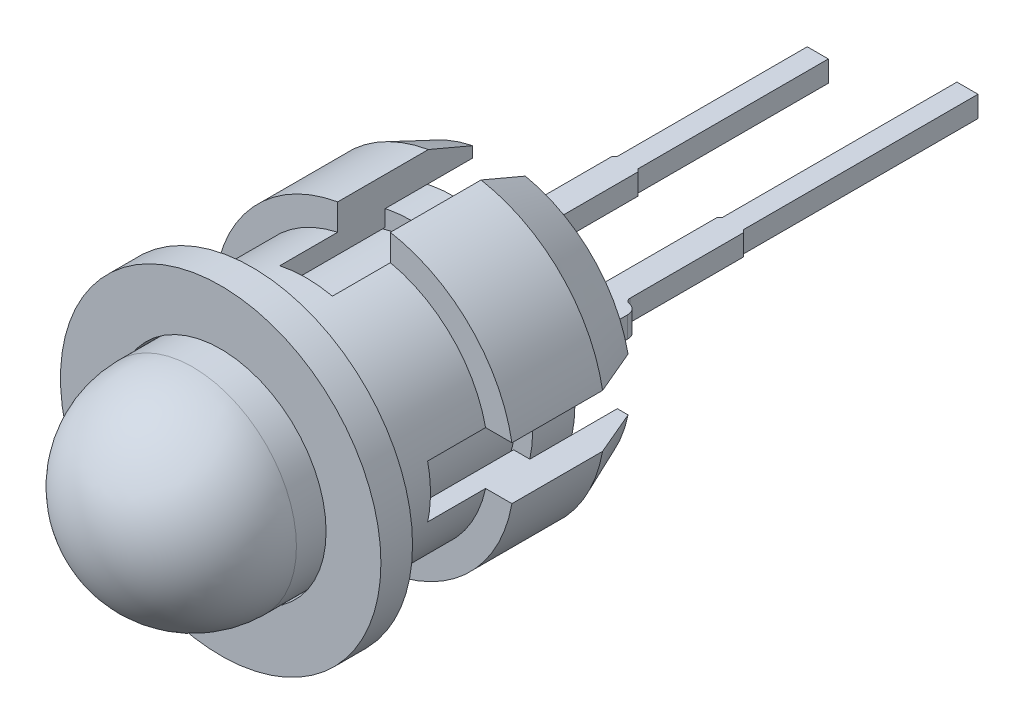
ISO-10303-21;
HEADER;
FILE_DESCRIPTION(('STEP AP214'),'2;1');
FILE_NAME('part.step','',(''),(''),'','','');
FILE_SCHEMA(('AUTOMOTIVE_DESIGN { 1 0 10303 214 1 1 1 1 }'));
ENDSEC;
DATA;
#1=APPLICATION_CONTEXT('core data for automotive mechanical design processes');
#2=APPLICATION_PROTOCOL_DEFINITION('international standard','automotive_design',2000,#1);
#3=PRODUCT_CONTEXT('',#1,'mechanical');
#4=PRODUCT('Part','Part','',(#3));
#5=PRODUCT_RELATED_PRODUCT_CATEGORY('part','',(#4));
#6=PRODUCT_DEFINITION_FORMATION('','',#4);
#7=PRODUCT_DEFINITION_CONTEXT('part definition',#1,'design');
#8=PRODUCT_DEFINITION('design','',#6,#7);
#9=PRODUCT_DEFINITION_SHAPE('','',#8);
#10=(LENGTH_UNIT() NAMED_UNIT(*) SI_UNIT(.MILLI.,.METRE.));
#11=(NAMED_UNIT(*) PLANE_ANGLE_UNIT() SI_UNIT($,.RADIAN.));
#12=(NAMED_UNIT(*) SI_UNIT($,.STERADIAN.) SOLID_ANGLE_UNIT());
#13=UNCERTAINTY_MEASURE_WITH_UNIT(LENGTH_MEASURE(1.E-05),#10,'distance_accuracy_value','');
#14=(GEOMETRIC_REPRESENTATION_CONTEXT(3) GLOBAL_UNCERTAINTY_ASSIGNED_CONTEXT((#13)) GLOBAL_UNIT_ASSIGNED_CONTEXT((#10,
#11,#12)) REPRESENTATION_CONTEXT('',''));
#15=CARTESIAN_POINT('',(0.,0.,0.));
#16=DIRECTION('',(0.,0.,1.));
#17=DIRECTION('',(1.,0.,0.));
#18=AXIS2_PLACEMENT_3D('',#15,#16,#17);
#19=CARTESIAN_POINT('',(0.,0.,10.2231613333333));
#20=DIRECTION('',(0.,0.,1.));
#21=DIRECTION('',(1.,0.,0.));
#22=AXIS2_PLACEMENT_3D('',#19,#20,#21);
#23=CYLINDRICAL_SURFACE('',#22,2.921);
#24=CARTESIAN_POINT('',(0.,0.,1.016));
#25=DIRECTION('',(0.,0.,1.));
#26=DIRECTION('',(1.,0.,0.));
#27=AXIS2_PLACEMENT_3D('',#24,#25,#26);
#28=CIRCLE('',#27,2.921);
#29=CARTESIAN_POINT('',(0.635,-2.85114292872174,1.016));
#30=VERTEX_POINT('',#29);
#31=CARTESIAN_POINT('',(2.85114292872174,-0.63500000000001,1.016));
#32=VERTEX_POINT('',#31);
#33=EDGE_CURVE('E459',#30,#32,#28,.T.);
#34=ORIENTED_EDGE('',*,*,#33,.T.);
#35=DIRECTION('',(0.,0.,1.));
#36=VECTOR('',#35,1.);
#37=CARTESIAN_POINT('',(2.85114292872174,-0.63500000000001,10.2231613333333));
#38=LINE('',#37,#36);
#39=CARTESIAN_POINT('',(2.85114292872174,-0.63500000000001,-1.0922));
#40=VERTEX_POINT('',#39);
#41=EDGE_CURVE('E578',#32,#40,#38,.F.);
#42=ORIENTED_EDGE('',*,*,#41,.T.);
#43=CARTESIAN_POINT('',(0.,0.,-1.0922));
#44=DIRECTION('',(0.,0.,1.));
#45=DIRECTION('',(1.,0.,0.));
#46=AXIS2_PLACEMENT_3D('',#43,#44,#45);
#47=CIRCLE('',#46,2.921);
#48=CARTESIAN_POINT('',(0.635,-2.85114292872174,-1.0922));
#49=VERTEX_POINT('',#48);
#50=EDGE_CURVE('E505',#49,#40,#47,.T.);
#51=ORIENTED_EDGE('',*,*,#50,.F.);
#52=DIRECTION('',(0.,0.,1.));
#53=VECTOR('',#52,1.);
#54=CARTESIAN_POINT('',(0.635,-2.85114292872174,10.2231613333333));
#55=LINE('',#54,#53);
#56=EDGE_CURVE('E413',#49,#30,#55,.T.);
#57=ORIENTED_EDGE('',*,*,#56,.T.);
#58=EDGE_LOOP('',(#34,#42,#51,#57));
#59=FACE_BOUND('',#58,.T.);
#60=ADVANCED_FACE('F43',(#59),#23,.F.);
#61=CARTESIAN_POINT('',(0.,1.81519030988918,-1.0922));
#62=DIRECTION('',(0.,0.,-1.));
#63=DIRECTION('',(-1.,0.,0.));
#64=AXIS2_PLACEMENT_3D('',#61,#62,#63);
#65=PLANE('',#64);
#66=ORIENTED_EDGE('',*,*,#50,.T.);
#67=DIRECTION('',(1.,0.,0.));
#68=VECTOR('',#67,1.);
#69=CARTESIAN_POINT('',(1.81519030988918,-0.635000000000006,-1.0922));
#70=LINE('',#69,#68);
#71=CARTESIAN_POINT('',(3.11085197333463,-0.635000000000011,-1.0922));
#72=VERTEX_POINT('',#71);
#73=EDGE_CURVE('E573',#40,#72,#70,.T.);
#74=ORIENTED_EDGE('',*,*,#73,.T.);
#75=CARTESIAN_POINT('',(0.,0.,-1.0922));
#76=DIRECTION('',(0.,0.,1.));
#77=DIRECTION('',(1.,0.,0.));
#78=AXIS2_PLACEMENT_3D('',#75,#76,#77);
#79=CIRCLE('',#78,3.175);
#80=CARTESIAN_POINT('',(0.635,-3.11085197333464,-1.0922));
#81=VERTEX_POINT('',#80);
#82=EDGE_CURVE('E499',#81,#72,#79,.T.);
#83=ORIENTED_EDGE('',*,*,#82,.F.);
#84=DIRECTION('',(0.,1.,0.));
#85=VECTOR('',#84,1.);
#86=CARTESIAN_POINT('',(0.635,1.81519030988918,-1.0922));
#87=LINE('',#86,#85);
#88=EDGE_CURVE('E380',#81,#49,#87,.T.);
#89=ORIENTED_EDGE('',*,*,#88,.T.);
#90=EDGE_LOOP('',(#66,#74,#83,#89));
#91=FACE_BOUND('',#90,.T.);
#92=ADVANCED_FACE('F722',(#91),#65,.T.);
#93=CARTESIAN_POINT('',(0.,0.,-0.0254000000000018));
#94=DIRECTION('',(0.,0.,1.));
#95=DIRECTION('',(1.,0.,0.));
#96=AXIS2_PLACEMENT_3D('',#93,#94,#95);
#97=CONICAL_SURFACE('',#96,3.6195,0.394791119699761);
#98=ORIENTED_EDGE('',*,*,#82,.T.);
#99=CARTESIAN_POINT('',(1.33723094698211,-0.635000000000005,-5.15937987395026));
#100=CARTESIAN_POINT('',(1.37455038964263,-0.635000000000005,-5.07846123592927));
#101=CARTESIAN_POINT('',(1.41164119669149,-0.635000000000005,-4.99743770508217));
#102=CARTESIAN_POINT('',(1.48544380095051,-0.635000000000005,-4.83521884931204));
#103=CARTESIAN_POINT('',(1.52215560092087,-0.635000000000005,-4.75402352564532));
#104=CARTESIAN_POINT('',(1.63183904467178,-0.635000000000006,-4.51023873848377));
#105=CARTESIAN_POINT('',(1.70436040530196,-0.635000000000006,-4.34744681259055));
#106=CARTESIAN_POINT('',(1.84858146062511,-0.635000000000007,-4.02150927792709));
#107=CARTESIAN_POINT('',(1.92028119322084,-0.635000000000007,-3.85836368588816));
#108=CARTESIAN_POINT('',(2.06308991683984,-0.635000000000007,-3.53181300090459));
#109=CARTESIAN_POINT('',(2.13419890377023,-0.635000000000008,-3.36840790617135));
#110=CARTESIAN_POINT('',(2.3796880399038,-0.635000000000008,-2.80226694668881));
#111=CARTESIAN_POINT('',(2.55298719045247,-0.635000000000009,-2.39906270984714));
#112=CARTESIAN_POINT('',(2.89822663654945,-0.63500000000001,-1.59206064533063));
#113=CARTESIAN_POINT('',(3.07016689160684,-0.635000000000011,-1.1882628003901));
#114=CARTESIAN_POINT('',(3.39709100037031,-0.635000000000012,-0.418277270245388));
#115=CARTESIAN_POINT('',(3.55214980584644,-0.635000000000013,-0.0521214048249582));
#116=CARTESIAN_POINT('',(3.86180545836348,-0.635000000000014,0.680385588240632));
#117=CARTESIAN_POINT('',(4.01640230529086,-0.635000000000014,1.04673671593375));
#118=CARTESIAN_POINT('',(4.32526030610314,-0.635000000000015,1.77955004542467));
#119=CARTESIAN_POINT('',(4.47952148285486,-0.635000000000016,2.14601223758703));
#120=CARTESIAN_POINT('',(4.78780031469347,-0.635000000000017,2.87903860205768));
#121=CARTESIAN_POINT('',(4.94181797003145,-0.635000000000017,3.24560277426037));
#122=CARTESIAN_POINT('',(5.09575465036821,-0.635000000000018,3.61220087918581));
#123=B_SPLINE_CURVE_WITH_KNOTS('',3,(#99,#100,#101,#102,#103,#104,#105,#106,#107,#108,#109,#110,
#111,#112,#113,#114,#115,#116,#117,#118,#119,#120,#121,#122),.UNSPECIFIED.,.F.,.F.,(4,2,2,2,2,2,
2,2,2,2,2,4),(0.,0.267328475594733,0.534655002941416,1.06929602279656,1.60391227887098,
2.13853223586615,3.45513401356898,4.77177487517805,5.96467841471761,7.15758224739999,
8.3504020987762,9.54322071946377),.UNSPECIFIED.);
#124=CARTESIAN_POINT('',(3.56336291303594,-0.635000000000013,-0.0254000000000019));
#125=VERTEX_POINT('',#124);
#126=EDGE_CURVE('E566',#72,#125,#123,.T.);
#127=ORIENTED_EDGE('',*,*,#126,.T.);
#128=CARTESIAN_POINT('',(0.,0.,-0.0254000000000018));
#129=DIRECTION('',(0.,0.,1.));
#130=DIRECTION('',(1.,0.,0.));
#131=AXIS2_PLACEMENT_3D('',#128,#129,#130);
#132=CIRCLE('',#131,3.6195);
#133=CARTESIAN_POINT('',(0.635,-3.56336291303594,-0.0254000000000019));
#134=VERTEX_POINT('',#133);
#135=EDGE_CURVE('E493',#134,#125,#132,.T.);
#136=ORIENTED_EDGE('',*,*,#135,.F.);
#137=CARTESIAN_POINT('',(0.635,-5.09575465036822,3.61220087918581));
#138=CARTESIAN_POINT('',(0.635,-4.94180944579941,3.24558251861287));
#139=CARTESIAN_POINT('',(0.635,-4.7877832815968,2.87899808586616));
#140=CARTESIAN_POINT('',(0.635,-4.47948834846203,2.14593346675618));
#141=CARTESIAN_POINT('',(0.635,-4.32521958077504,1.77945327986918));
#142=CARTESIAN_POINT('',(0.635,-4.01636239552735,1.04664216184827));
#143=CARTESIAN_POINT('',(0.635,-3.86177398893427,0.680311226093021));
#144=CARTESIAN_POINT('',(0.635,-3.55213455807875,-0.0521575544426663));
#145=CARTESIAN_POINT('',(0.635,-3.39708353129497,-0.41829539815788));
#146=CARTESIAN_POINT('',(0.635,-3.08628552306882,-1.15029897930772));
#147=CARTESIAN_POINT('',(0.635,-2.93053850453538,-1.51616470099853));
#148=CARTESIAN_POINT('',(0.635,-2.61797235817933,-2.24743344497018));
#149=CARTESIAN_POINT('',(0.635,-2.46115324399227,-2.61283647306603));
#150=CARTESIAN_POINT('',(0.635,-2.22450972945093,-3.16034137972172));
#151=CARTESIAN_POINT('',(0.635,-2.14539064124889,-3.34274788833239));
#152=CARTESIAN_POINT('',(0.635,-1.9864943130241,-3.70727260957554));
#153=CARTESIAN_POINT('',(0.635,-1.90671707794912,-3.8893908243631));
#154=CARTESIAN_POINT('',(0.635,-1.74622227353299,-4.25322337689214));
#155=CARTESIAN_POINT('',(0.635,-1.66550466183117,-4.43493769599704));
#156=CARTESIAN_POINT('',(0.635,-1.54336065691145,-4.70703310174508));
#157=CARTESIAN_POINT('',(0.635,-1.50246753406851,-4.79765336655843));
#158=CARTESIAN_POINT('',(0.635,-1.42022073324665,-4.97868553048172));
#159=CARTESIAN_POINT('',(0.635,-1.37886705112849,-5.06909742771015));
#160=CARTESIAN_POINT('',(0.635,-1.33723094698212,-5.15937987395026));
#161=B_SPLINE_CURVE_WITH_KNOTS('',3,(#137,#138,#139,#140,#141,#142,#143,#144,#145,#146,#147,
#148,#149,#150,#151,#152,#153,#154,#155,#156,#157,#158,#159,#160),.UNSPECIFIED.,.F.,.F.,(4,2,2,
2,2,2,2,2,2,2,2,4),(0.,1.19288454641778,2.38576299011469,3.57860116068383,4.77144584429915,
5.96435487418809,7.15724876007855,7.75372722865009,8.35020121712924,8.94670217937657,
9.24496019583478,9.54322089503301),.UNSPECIFIED.);
#162=EDGE_CURVE('E405',#134,#81,#161,.T.);
#163=ORIENTED_EDGE('',*,*,#162,.T.);
#164=EDGE_LOOP('',(#98,#127,#136,#163));
#165=FACE_BOUND('',#164,.T.);
#166=ADVANCED_FACE('F726',(#165),#97,.T.);
#167=CARTESIAN_POINT('',(0.,0.,10.2231613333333));
#168=DIRECTION('',(0.,0.,1.));
#169=DIRECTION('',(1.,0.,0.));
#170=AXIS2_PLACEMENT_3D('',#167,#168,#169);
#171=CYLINDRICAL_SURFACE('',#170,3.6195);
#172=ORIENTED_EDGE('',*,*,#135,.T.);
#173=DIRECTION('',(0.,0.,1.));
#174=VECTOR('',#173,1.);
#175=CARTESIAN_POINT('',(3.56336291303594,-0.635000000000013,10.2231613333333));
#176=LINE('',#175,#174);
#177=CARTESIAN_POINT('',(3.56336291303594,-0.635000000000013,2.159));
#178=VERTEX_POINT('',#177);
#179=EDGE_CURVE('E574',#125,#178,#176,.T.);
#180=ORIENTED_EDGE('',*,*,#179,.T.);
#181=CARTESIAN_POINT('',(0.,0.,2.159));
#182=DIRECTION('',(0.,0.,1.));
#183=DIRECTION('',(1.,0.,0.));
#184=AXIS2_PLACEMENT_3D('',#181,#182,#183);
#185=CIRCLE('',#184,3.6195);
#186=CARTESIAN_POINT('',(0.635,-3.56336291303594,2.159));
#187=VERTEX_POINT('',#186);
#188=EDGE_CURVE('E487',#187,#178,#185,.T.);
#189=ORIENTED_EDGE('',*,*,#188,.F.);
#190=DIRECTION('',(0.,0.,1.));
#191=VECTOR('',#190,1.);
#192=CARTESIAN_POINT('',(0.635,-3.56336291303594,10.2231613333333));
#193=LINE('',#192,#191);
#194=EDGE_CURVE('E412',#187,#134,#193,.F.);
#195=ORIENTED_EDGE('',*,*,#194,.T.);
#196=EDGE_LOOP('',(#172,#180,#189,#195));
#197=FACE_BOUND('',#196,.T.);
#198=ADVANCED_FACE('F598',(#197),#171,.T.);
#199=CARTESIAN_POINT('',(0.,1.8151903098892,2.159));
#200=DIRECTION('',(0.,0.,1.));
#201=DIRECTION('',(1.,0.,0.));
#202=AXIS2_PLACEMENT_3D('',#199,#200,#201);
#203=PLANE('',#202);
#204=ORIENTED_EDGE('',*,*,#188,.T.);
#205=DIRECTION('',(-1.,0.,0.));
#206=VECTOR('',#205,1.);
#207=CARTESIAN_POINT('',(1.81519030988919,-0.635000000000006,2.159));
#208=LINE('',#207,#206);
#209=CARTESIAN_POINT('',(2.92916077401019,-0.63500000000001,2.159));
#210=VERTEX_POINT('',#209);
#211=EDGE_CURVE('E600',#178,#210,#208,.T.);
#212=ORIENTED_EDGE('',*,*,#211,.T.);
#213=CARTESIAN_POINT('',(0.,0.,2.159));
#214=DIRECTION('',(0.,0.,1.));
#215=DIRECTION('',(1.,0.,0.));
#216=AXIS2_PLACEMENT_3D('',#213,#214,#215);
#217=CIRCLE('',#216,2.9972);
#218=CARTESIAN_POINT('',(0.635,-2.92916077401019,2.159));
#219=VERTEX_POINT('',#218);
#220=EDGE_CURVE('E296',#219,#210,#217,.T.);
#221=ORIENTED_EDGE('',*,*,#220,.F.);
#222=DIRECTION('',(0.,-1.,0.));
#223=VECTOR('',#222,1.);
#224=CARTESIAN_POINT('',(0.635,1.8151903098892,2.159));
#225=LINE('',#224,#223);
#226=EDGE_CURVE('E417',#219,#187,#225,.T.);
#227=ORIENTED_EDGE('',*,*,#226,.T.);
#228=EDGE_LOOP('',(#204,#212,#221,#227));
#229=FACE_BOUND('',#228,.T.);
#230=ADVANCED_FACE('F595',(#229),#203,.T.);
#231=CARTESIAN_POINT('',(0.,1.81519030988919,1.016));
#232=DIRECTION('',(0.,0.,-1.));
#233=DIRECTION('',(-1.,0.,0.));
#234=AXIS2_PLACEMENT_3D('',#231,#232,#233);
#235=PLANE('',#234);
#236=CARTESIAN_POINT('',(0.,0.,1.016));
#237=DIRECTION('',(0.,0.,1.));
#238=DIRECTION('',(1.,0.,0.));
#239=AXIS2_PLACEMENT_3D('',#236,#237,#238);
#240=CIRCLE('',#239,2.54);
#241=CARTESIAN_POINT('',(0.635,-2.45934442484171,1.016));
#242=VERTEX_POINT('',#241);
#243=CARTESIAN_POINT('',(2.45934442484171,-0.635000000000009,1.016));
#244=VERTEX_POINT('',#243);
#245=EDGE_CURVE('E465',#242,#244,#240,.T.);
#246=ORIENTED_EDGE('',*,*,#245,.T.);
#247=DIRECTION('',(1.,0.,0.));
#248=VECTOR('',#247,1.);
#249=CARTESIAN_POINT('',(1.81519030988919,-0.635000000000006,1.016));
#250=LINE('',#249,#248);
#251=EDGE_CURVE('E301',#244,#32,#250,.T.);
#252=ORIENTED_EDGE('',*,*,#251,.T.);
#253=ORIENTED_EDGE('',*,*,#33,.F.);
#254=DIRECTION('',(0.,1.,0.));
#255=VECTOR('',#254,1.);
#256=CARTESIAN_POINT('',(0.635,1.81519030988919,1.016));
#257=LINE('',#256,#255);
#258=EDGE_CURVE('E513',#30,#242,#257,.T.);
#259=ORIENTED_EDGE('',*,*,#258,.T.);
#260=EDGE_LOOP('',(#246,#252,#253,#259));
#261=FACE_BOUND('',#260,.T.);
#262=ADVANCED_FACE('F524',(#261),#235,.T.);
#263=CARTESIAN_POINT('',(0.,0.,10.2231613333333));
#264=DIRECTION('',(0.,0.,1.));
#265=DIRECTION('',(1.,0.,0.));
#266=AXIS2_PLACEMENT_3D('',#263,#264,#265);
#267=CYLINDRICAL_SURFACE('',#266,2.9972);
#268=CARTESIAN_POINT('',(0.,0.,4.8514));
#269=DIRECTION('',(0.,0.,1.));
#270=DIRECTION('',(1.,0.,0.));
#271=AXIS2_PLACEMENT_3D('',#268,#269,#270);
#272=CIRCLE('',#271,2.9972);
#273=CARTESIAN_POINT('',(2.9972,0.,4.8514));
#274=VERTEX_POINT('',#273);
#275=EDGE_CURVE('E480',#274,#274,#272,.T.);
#276=ORIENTED_EDGE('',*,*,#275,.F.);
#277=EDGE_LOOP('',(#276));
#278=FACE_BOUND('',#277,.T.);
#279=ORIENTED_EDGE('',*,*,#220,.T.);
#280=DIRECTION('',(0.,0.,1.));
#281=VECTOR('',#280,1.);
#282=CARTESIAN_POINT('',(2.92916077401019,-0.63500000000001,10.2231613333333));
#283=LINE('',#282,#281);
#284=CARTESIAN_POINT('',(2.92916077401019,-0.63500000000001,3.556));
#285=VERTEX_POINT('',#284);
#286=EDGE_CURVE('E288',#210,#285,#283,.T.);
#287=ORIENTED_EDGE('',*,*,#286,.T.);
#288=CARTESIAN_POINT('',(0.,0.,3.556));
#289=DIRECTION('',(0.,0.,1.));
#290=DIRECTION('',(0.,-1.,0.));
#291=AXIS2_PLACEMENT_3D('',#288,#289,#290);
#292=CIRCLE('',#291,2.9972);
#293=CARTESIAN_POINT('',(2.9291607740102,0.63499999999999,3.556));
#294=VERTEX_POINT('',#293);
#295=EDGE_CURVE('E276',#294,#285,#292,.F.);
#296=ORIENTED_EDGE('',*,*,#295,.F.);
#297=DIRECTION('',(0.,0.,1.));
#298=VECTOR('',#297,1.);
#299=CARTESIAN_POINT('',(2.9291607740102,0.63499999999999,10.2231613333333));
#300=LINE('',#299,#298);
#301=CARTESIAN_POINT('',(2.9291607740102,0.63499999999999,2.159));
#302=VERTEX_POINT('',#301);
#303=EDGE_CURVE('E537',#302,#294,#300,.T.);
#304=ORIENTED_EDGE('',*,*,#303,.F.);
#305=CARTESIAN_POINT('',(0.635,2.92916077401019,2.159));
#306=VERTEX_POINT('',#305);
#307=EDGE_CURVE('E483',#302,#306,#217,.T.);
#308=ORIENTED_EDGE('',*,*,#307,.T.);
#309=DIRECTION('',(0.,0.,1.));
#310=VECTOR('',#309,1.);
#311=CARTESIAN_POINT('',(0.635,2.92916077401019,10.2231613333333));
#312=LINE('',#311,#310);
#313=CARTESIAN_POINT('',(0.635,2.92916077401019,3.556));
#314=VERTEX_POINT('',#313);
#315=EDGE_CURVE('E583',#306,#314,#312,.T.);
#316=ORIENTED_EDGE('',*,*,#315,.T.);
#317=CARTESIAN_POINT('',(0.,0.,3.556));
#318=DIRECTION('',(0.,0.,1.));
#319=DIRECTION('',(1.,0.,0.));
#320=AXIS2_PLACEMENT_3D('',#317,#318,#319);
#321=CIRCLE('',#320,2.9972);
#322=CARTESIAN_POINT('',(-0.635,2.92916077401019,3.556));
#323=VERTEX_POINT('',#322);
#324=EDGE_CURVE('E456',#323,#314,#321,.F.);
#325=ORIENTED_EDGE('',*,*,#324,.F.);
#326=DIRECTION('',(0.,0.,1.));
#327=VECTOR('',#326,1.);
#328=CARTESIAN_POINT('',(-0.635,2.92916077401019,10.2231613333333));
#329=LINE('',#328,#327);
#330=CARTESIAN_POINT('',(-0.635,2.92916077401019,2.159));
#331=VERTEX_POINT('',#330);
#332=EDGE_CURVE('E436',#331,#323,#329,.T.);
#333=ORIENTED_EDGE('',*,*,#332,.F.);
#334=CARTESIAN_POINT('',(-2.92916077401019,0.63500000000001,2.159));
#335=VERTEX_POINT('',#334);
#336=EDGE_CURVE('E486',#331,#335,#217,.T.);
#337=ORIENTED_EDGE('',*,*,#336,.T.);
#338=DIRECTION('',(0.,0.,1.));
#339=VECTOR('',#338,1.);
#340=CARTESIAN_POINT('',(-2.92916077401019,0.63500000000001,10.2231613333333));
#341=LINE('',#340,#339);
#342=CARTESIAN_POINT('',(-2.92916077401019,0.63500000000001,3.556));
#343=VERTEX_POINT('',#342);
#344=EDGE_CURVE('E706',#343,#335,#341,.F.);
#345=ORIENTED_EDGE('',*,*,#344,.F.);
#346=CARTESIAN_POINT('',(0.,0.,3.556));
#347=DIRECTION('',(0.,0.,1.));
#348=DIRECTION('',(0.,-1.,0.));
#349=AXIS2_PLACEMENT_3D('',#346,#347,#348);
#350=CIRCLE('',#349,2.9972);
#351=CARTESIAN_POINT('',(-2.9291607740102,-0.63499999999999,3.556));
#352=VERTEX_POINT('',#351);
#353=EDGE_CURVE('E297',#352,#343,#350,.F.);
#354=ORIENTED_EDGE('',*,*,#353,.F.);
#355=DIRECTION('',(0.,0.,1.));
#356=VECTOR('',#355,1.);
#357=CARTESIAN_POINT('',(-2.9291607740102,-0.63499999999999,10.2231613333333));
#358=LINE('',#357,#356);
#359=CARTESIAN_POINT('',(-2.9291607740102,-0.63499999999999,2.159));
#360=VERTEX_POINT('',#359);
#361=EDGE_CURVE('E691',#352,#360,#358,.F.);
#362=ORIENTED_EDGE('',*,*,#361,.T.);
#363=CARTESIAN_POINT('',(-0.635,-2.92916077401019,2.159));
#364=VERTEX_POINT('',#363);
#365=EDGE_CURVE('E485',#360,#364,#217,.T.);
#366=ORIENTED_EDGE('',*,*,#365,.T.);
#367=DIRECTION('',(0.,0.,1.));
#368=VECTOR('',#367,1.);
#369=CARTESIAN_POINT('',(-0.635,-2.92916077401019,10.2231613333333));
#370=LINE('',#369,#368);
#371=CARTESIAN_POINT('',(-0.635,-2.92916077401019,3.556));
#372=VERTEX_POINT('',#371);
#373=EDGE_CURVE('E453',#372,#364,#370,.F.);
#374=ORIENTED_EDGE('',*,*,#373,.F.);
#375=CARTESIAN_POINT('',(0.635,-2.92916077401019,3.556));
#376=VERTEX_POINT('',#375);
#377=EDGE_CURVE('E458',#376,#372,#321,.F.);
#378=ORIENTED_EDGE('',*,*,#377,.F.);
#379=DIRECTION('',(0.,0.,1.));
#380=VECTOR('',#379,1.);
#381=CARTESIAN_POINT('',(0.635,-2.92916077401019,10.2231613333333));
#382=LINE('',#381,#380);
#383=EDGE_CURVE('E418',#376,#219,#382,.F.);
#384=ORIENTED_EDGE('',*,*,#383,.T.);
#385=EDGE_LOOP('',(#279,#287,#296,#304,#308,#316,#325,#333,#337,#345,#354,#362,#366,#374,#378,#384));
#386=FACE_BOUND('',#385,.T.);
#387=ADVANCED_FACE('F293',(#278,#386),#267,.T.);
#388=CARTESIAN_POINT('',(0.,0.,10.2231613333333));
#389=DIRECTION('',(0.,0.,1.));
#390=DIRECTION('',(1.,0.,0.));
#391=AXIS2_PLACEMENT_3D('',#388,#389,#390);
#392=CYLINDRICAL_SURFACE('',#391,2.54);
#393=CARTESIAN_POINT('',(0.,0.,5.6134));
#394=DIRECTION('',(0.,0.,1.));
#395=DIRECTION('',(1.,0.,0.));
#396=AXIS2_PLACEMENT_3D('',#393,#394,#395);
#397=CIRCLE('',#396,2.54);
#398=CARTESIAN_POINT('',(2.54,0.,5.6134));
#399=VERTEX_POINT('',#398);
#400=EDGE_CURVE('E471',#399,#399,#397,.T.);
#401=ORIENTED_EDGE('',*,*,#400,.T.);
#402=EDGE_LOOP('',(#401));
#403=FACE_BOUND('',#402,.T.);
#404=CARTESIAN_POINT('',(0.,0.,3.556));
#405=DIRECTION('',(0.,0.,1.));
#406=DIRECTION('',(0.,-1.,0.));
#407=AXIS2_PLACEMENT_3D('',#404,#405,#406);
#408=CIRCLE('',#407,2.54);
#409=CARTESIAN_POINT('',(2.45934442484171,-0.635000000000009,3.556));
#410=VERTEX_POINT('',#409);
#411=CARTESIAN_POINT('',(2.45934442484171,0.634999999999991,3.556));
#412=VERTEX_POINT('',#411);
#413=EDGE_CURVE('E290',#410,#412,#408,.T.);
#414=ORIENTED_EDGE('',*,*,#413,.F.);
#415=DIRECTION('',(0.,0.,1.));
#416=VECTOR('',#415,1.);
#417=CARTESIAN_POINT('',(2.45934442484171,-0.635000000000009,10.2231613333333));
#418=LINE('',#417,#416);
#419=EDGE_CURVE('E58',#410,#244,#418,.F.);
#420=ORIENTED_EDGE('',*,*,#419,.T.);
#421=ORIENTED_EDGE('',*,*,#245,.F.);
#422=DIRECTION('',(0.,0.,1.));
#423=VECTOR('',#422,1.);
#424=CARTESIAN_POINT('',(0.635,-2.45934442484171,10.2231613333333));
#425=LINE('',#424,#423);
#426=CARTESIAN_POINT('',(0.635,-2.45934442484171,3.556));
#427=VERTEX_POINT('',#426);
#428=EDGE_CURVE('E532',#242,#427,#425,.T.);
#429=ORIENTED_EDGE('',*,*,#428,.T.);
#430=CARTESIAN_POINT('',(0.,0.,3.556));
#431=DIRECTION('',(0.,0.,1.));
#432=DIRECTION('',(1.,0.,0.));
#433=AXIS2_PLACEMENT_3D('',#430,#431,#432);
#434=CIRCLE('',#433,2.54);
#435=CARTESIAN_POINT('',(-0.635,-2.45934442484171,3.556));
#436=VERTEX_POINT('',#435);
#437=EDGE_CURVE('E47',#436,#427,#434,.T.);
#438=ORIENTED_EDGE('',*,*,#437,.F.);
#439=DIRECTION('',(0.,0.,1.));
#440=VECTOR('',#439,1.);
#441=CARTESIAN_POINT('',(-0.635,-2.45934442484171,10.2231613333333));
#442=LINE('',#441,#440);
#443=CARTESIAN_POINT('',(-0.635,-2.45934442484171,1.016));
#444=VERTEX_POINT('',#443);
#445=EDGE_CURVE('E439',#444,#436,#442,.T.);
#446=ORIENTED_EDGE('',*,*,#445,.F.);
#447=CARTESIAN_POINT('',(-2.45934442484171,-0.634999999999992,1.016));
#448=VERTEX_POINT('',#447);
#449=EDGE_CURVE('E468',#448,#444,#240,.T.);
#450=ORIENTED_EDGE('',*,*,#449,.F.);
#451=DIRECTION('',(0.,0.,1.));
#452=VECTOR('',#451,1.);
#453=CARTESIAN_POINT('',(-2.45934442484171,-0.634999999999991,10.2231613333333));
#454=LINE('',#453,#452);
#455=CARTESIAN_POINT('',(-2.45934442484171,-0.634999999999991,3.556));
#456=VERTEX_POINT('',#455);
#457=EDGE_CURVE('E66',#448,#456,#454,.T.);
#458=ORIENTED_EDGE('',*,*,#457,.T.);
#459=CARTESIAN_POINT('',(0.,0.,3.556));
#460=DIRECTION('',(0.,0.,1.));
#461=DIRECTION('',(0.,-1.,0.));
#462=AXIS2_PLACEMENT_3D('',#459,#460,#461);
#463=CIRCLE('',#462,2.54);
#464=CARTESIAN_POINT('',(-2.45934442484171,0.635000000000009,3.556));
#465=VERTEX_POINT('',#464);
#466=EDGE_CURVE('E307',#465,#456,#463,.T.);
#467=ORIENTED_EDGE('',*,*,#466,.F.);
#468=DIRECTION('',(0.,0.,1.));
#469=VECTOR('',#468,1.);
#470=CARTESIAN_POINT('',(-2.45934442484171,0.635000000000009,10.2231613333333));
#471=LINE('',#470,#469);
#472=CARTESIAN_POINT('',(-2.45934442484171,0.635000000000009,1.016));
#473=VERTEX_POINT('',#472);
#474=EDGE_CURVE('E359',#473,#465,#471,.T.);
#475=ORIENTED_EDGE('',*,*,#474,.F.);
#476=CARTESIAN_POINT('',(-0.635,2.45934442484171,1.016));
#477=VERTEX_POINT('',#476);
#478=EDGE_CURVE('E470',#477,#473,#240,.T.);
#479=ORIENTED_EDGE('',*,*,#478,.F.);
#480=DIRECTION('',(0.,0.,1.));
#481=VECTOR('',#480,1.);
#482=CARTESIAN_POINT('',(-0.635,2.45934442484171,10.2231613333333));
#483=LINE('',#482,#481);
#484=CARTESIAN_POINT('',(-0.635,2.45934442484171,3.556));
#485=VERTEX_POINT('',#484);
#486=EDGE_CURVE('E420',#485,#477,#483,.F.);
#487=ORIENTED_EDGE('',*,*,#486,.F.);
#488=CARTESIAN_POINT('',(0.635,2.45934442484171,3.556));
#489=VERTEX_POINT('',#488);
#490=EDGE_CURVE('E12',#489,#485,#434,.T.);
#491=ORIENTED_EDGE('',*,*,#490,.F.);
#492=DIRECTION('',(0.,0.,1.));
#493=VECTOR('',#492,1.);
#494=CARTESIAN_POINT('',(0.635,2.45934442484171,10.2231613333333));
#495=LINE('',#494,#493);
#496=CARTESIAN_POINT('',(0.635,2.45934442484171,1.016));
#497=VERTEX_POINT('',#496);
#498=EDGE_CURVE('E370',#489,#497,#495,.F.);
#499=ORIENTED_EDGE('',*,*,#498,.T.);
#500=CARTESIAN_POINT('',(2.45934442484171,0.634999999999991,1.016));
#501=VERTEX_POINT('',#500);
#502=EDGE_CURVE('E469',#501,#497,#240,.T.);
#503=ORIENTED_EDGE('',*,*,#502,.F.);
#504=DIRECTION('',(0.,0.,1.));
#505=VECTOR('',#504,1.);
#506=CARTESIAN_POINT('',(2.45934442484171,0.634999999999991,10.2231613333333));
#507=LINE('',#506,#505);
#508=EDGE_CURVE('E535',#412,#501,#507,.F.);
#509=ORIENTED_EDGE('',*,*,#508,.F.);
#510=EDGE_LOOP('',(#414,#420,#421,#429,#438,#446,#450,#458,#467,#475,#479,#487,#491,#499,#503,#509));
#511=FACE_BOUND('',#510,.T.);
#512=ADVANCED_FACE('F530',(#403,#511),#392,.F.);
#513=CARTESIAN_POINT('',(-2.85114292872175,-0.63499999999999,-1.0922));
#514=VERTEX_POINT('',#513);
#515=CARTESIAN_POINT('',(-0.635,-2.85114292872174,-1.0922));
#516=VERTEX_POINT('',#515);
#517=EDGE_CURVE('E508',#514,#516,#47,.T.);
#518=ORIENTED_EDGE('',*,*,#517,.F.);
#519=DIRECTION('',(0.,0.,1.));
#520=VECTOR('',#519,1.);
#521=CARTESIAN_POINT('',(-2.85114292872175,-0.63499999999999,10.2231613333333));
#522=LINE('',#521,#520);
#523=CARTESIAN_POINT('',(-2.85114292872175,-0.63499999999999,1.016));
#524=VERTEX_POINT('',#523);
#525=EDGE_CURVE('E314',#514,#524,#522,.T.);
#526=ORIENTED_EDGE('',*,*,#525,.T.);
#527=CARTESIAN_POINT('',(-0.635,-2.85114292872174,1.016));
#528=VERTEX_POINT('',#527);
#529=EDGE_CURVE('E462',#524,#528,#28,.T.);
#530=ORIENTED_EDGE('',*,*,#529,.T.);
#531=DIRECTION('',(0.,0.,1.));
#532=VECTOR('',#531,1.);
#533=CARTESIAN_POINT('',(-0.635,-2.85114292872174,10.2231613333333));
#534=LINE('',#533,#532);
#535=EDGE_CURVE('E441',#516,#528,#534,.T.);
#536=ORIENTED_EDGE('',*,*,#535,.F.);
#537=EDGE_LOOP('',(#518,#526,#530,#536));
#538=FACE_BOUND('',#537,.T.);
#539=ADVANCED_FACE('F713',(#538),#23,.F.);
#540=CARTESIAN_POINT('',(-3.11085197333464,-0.634999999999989,-1.0922));
#541=VERTEX_POINT('',#540);
#542=CARTESIAN_POINT('',(-0.635,-3.11085197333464,-1.0922));
#543=VERTEX_POINT('',#542);
#544=EDGE_CURVE('E502',#541,#543,#79,.T.);
#545=ORIENTED_EDGE('',*,*,#544,.F.);
#546=DIRECTION('',(1.,0.,0.));
#547=VECTOR('',#546,1.);
#548=CARTESIAN_POINT('',(1.81519030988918,-0.635000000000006,-1.0922));
#549=LINE('',#548,#547);
#550=EDGE_CURVE('E317',#541,#514,#549,.T.);
#551=ORIENTED_EDGE('',*,*,#550,.T.);
#552=ORIENTED_EDGE('',*,*,#517,.T.);
#553=DIRECTION('',(0.,1.,0.));
#554=VECTOR('',#553,1.);
#555=CARTESIAN_POINT('',(-0.635,1.81519030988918,-1.0922));
#556=LINE('',#555,#554);
#557=EDGE_CURVE('E427',#543,#516,#556,.T.);
#558=ORIENTED_EDGE('',*,*,#557,.F.);
#559=EDGE_LOOP('',(#545,#551,#552,#558));
#560=FACE_BOUND('',#559,.T.);
#561=ADVANCED_FACE('F712',(#560),#65,.T.);
#562=CARTESIAN_POINT('',(-3.56336291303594,-0.634999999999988,-0.0254000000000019));
#563=VERTEX_POINT('',#562);
#564=CARTESIAN_POINT('',(-0.635,-3.56336291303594,-0.0254000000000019));
#565=VERTEX_POINT('',#564);
#566=EDGE_CURVE('E496',#563,#565,#132,.T.);
#567=ORIENTED_EDGE('',*,*,#566,.F.);
#568=CARTESIAN_POINT('',(-5.09575465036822,-0.634999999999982,3.61220087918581));
#569=CARTESIAN_POINT('',(-4.94180944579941,-0.634999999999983,3.24558251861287));
#570=CARTESIAN_POINT('',(-4.78778328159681,-0.634999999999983,2.87899808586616));
#571=CARTESIAN_POINT('',(-4.47948834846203,-0.634999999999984,2.14593346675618));
#572=CARTESIAN_POINT('',(-4.32521958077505,-0.634999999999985,1.77945327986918));
#573=CARTESIAN_POINT('',(-4.01636239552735,-0.634999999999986,1.04664216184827));
#574=CARTESIAN_POINT('',(-3.86177398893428,-0.634999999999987,0.680311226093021));
#575=CARTESIAN_POINT('',(-3.55213455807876,-0.634999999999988,-0.0521575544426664));
#576=CARTESIAN_POINT('',(-3.39708353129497,-0.634999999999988,-0.418295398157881));
#577=CARTESIAN_POINT('',(-3.08628552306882,-0.634999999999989,-1.15029897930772));
#578=CARTESIAN_POINT('',(-2.93053850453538,-0.63499999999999,-1.51616470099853));
#579=CARTESIAN_POINT('',(-2.61797235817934,-0.634999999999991,-2.24743344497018));
#580=CARTESIAN_POINT('',(-2.46115324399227,-0.634999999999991,-2.61283647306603));
#581=CARTESIAN_POINT('',(-2.22450972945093,-0.634999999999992,-3.16034137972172));
#582=CARTESIAN_POINT('',(-2.1453906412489,-0.634999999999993,-3.34274788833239));
#583=CARTESIAN_POINT('',(-1.9864943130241,-0.634999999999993,-3.70727260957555));
#584=CARTESIAN_POINT('',(-1.90671707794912,-0.634999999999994,-3.8893908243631));
#585=CARTESIAN_POINT('',(-1.746222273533,-0.634999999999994,-4.25322337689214));
#586=CARTESIAN_POINT('',(-1.66550466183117,-0.634999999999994,-4.43493769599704));
#587=CARTESIAN_POINT('',(-1.54336065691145,-0.634999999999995,-4.70703310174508));
#588=CARTESIAN_POINT('',(-1.50246753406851,-0.634999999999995,-4.79765336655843));
#589=CARTESIAN_POINT('',(-1.42022073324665,-0.634999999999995,-4.97868553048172));
#590=CARTESIAN_POINT('',(-1.37886705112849,-0.634999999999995,-5.06909742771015));
#591=CARTESIAN_POINT('',(-1.33723094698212,-0.634999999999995,-5.15937987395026));
#592=B_SPLINE_CURVE_WITH_KNOTS('',3,(#568,#569,#570,#571,#572,#573,#574,#575,#576,#577,#578,
#579,#580,#581,#582,#583,#584,#585,#586,#587,#588,#589,#590,#591),.UNSPECIFIED.,.F.,.F.,(4,2,2,
2,2,2,2,2,2,2,2,4),(0.,1.19288454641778,2.38576299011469,3.57860116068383,4.77144584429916,
5.96435487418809,7.15724876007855,7.75372722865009,8.35020121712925,8.94670217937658,
9.24496019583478,9.54322089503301),.UNSPECIFIED.);
#593=EDGE_CURVE('E320',#563,#541,#592,.T.);
#594=ORIENTED_EDGE('',*,*,#593,.T.);
#595=ORIENTED_EDGE('',*,*,#544,.T.);
#596=CARTESIAN_POINT('',(-0.635,-5.09575465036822,3.61220087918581));
#597=CARTESIAN_POINT('',(-0.635,-4.94180944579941,3.24558251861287));
#598=CARTESIAN_POINT('',(-0.635,-4.7877832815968,2.87899808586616));
#599=CARTESIAN_POINT('',(-0.635,-4.47948834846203,2.14593346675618));
#600=CARTESIAN_POINT('',(-0.635,-4.32521958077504,1.77945327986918));
#601=CARTESIAN_POINT('',(-0.635,-4.01636239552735,1.04664216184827));
#602=CARTESIAN_POINT('',(-0.635,-3.86177398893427,0.680311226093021));
#603=CARTESIAN_POINT('',(-0.635,-3.55213455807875,-0.0521575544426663));
#604=CARTESIAN_POINT('',(-0.635,-3.39708353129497,-0.41829539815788));
#605=CARTESIAN_POINT('',(-0.635,-3.08628552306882,-1.15029897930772));
#606=CARTESIAN_POINT('',(-0.635,-2.93053850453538,-1.51616470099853));
#607=CARTESIAN_POINT('',(-0.635,-2.61797235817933,-2.24743344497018));
#608=CARTESIAN_POINT('',(-0.635,-2.46115324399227,-2.61283647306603));
#609=CARTESIAN_POINT('',(-0.635,-2.22450972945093,-3.16034137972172));
#610=CARTESIAN_POINT('',(-0.635,-2.14539064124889,-3.34274788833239));
#611=CARTESIAN_POINT('',(-0.635,-1.9864943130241,-3.70727260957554));
#612=CARTESIAN_POINT('',(-0.635,-1.90671707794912,-3.8893908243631));
#613=CARTESIAN_POINT('',(-0.635,-1.74622227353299,-4.25322337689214));
#614=CARTESIAN_POINT('',(-0.635,-1.66550466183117,-4.43493769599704));
#615=CARTESIAN_POINT('',(-0.635,-1.54336065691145,-4.70703310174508));
#616=CARTESIAN_POINT('',(-0.635,-1.50246753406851,-4.79765336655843));
#617=CARTESIAN_POINT('',(-0.635,-1.42022073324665,-4.97868553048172));
#618=CARTESIAN_POINT('',(-0.635,-1.37886705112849,-5.06909742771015));
#619=CARTESIAN_POINT('',(-0.635,-1.33723094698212,-5.15937987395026));
#620=B_SPLINE_CURVE_WITH_KNOTS('',3,(#596,#597,#598,#599,#600,#601,#602,#603,#604,#605,#606,
#607,#608,#609,#610,#611,#612,#613,#614,#615,#616,#617,#618,#619),.UNSPECIFIED.,.F.,.F.,(4,2,2,
2,2,2,2,2,2,2,2,4),(0.,1.19288454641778,2.38576299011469,3.57860116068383,4.77144584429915,
5.96435487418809,7.15724876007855,7.75372722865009,8.35020121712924,8.94670217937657,
9.24496019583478,9.54322089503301),.UNSPECIFIED.);
#621=EDGE_CURVE('E444',#565,#543,#620,.T.);
#622=ORIENTED_EDGE('',*,*,#621,.F.);
#623=EDGE_LOOP('',(#567,#594,#595,#622));
#624=FACE_BOUND('',#623,.T.);
#625=ADVANCED_FACE('F711',(#624),#97,.T.);
#626=CARTESIAN_POINT('',(-3.56336291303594,-0.634999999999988,2.159));
#627=VERTEX_POINT('',#626);
#628=CARTESIAN_POINT('',(-0.635,-3.56336291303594,2.159));
#629=VERTEX_POINT('',#628);
#630=EDGE_CURVE('E490',#627,#629,#185,.T.);
#631=ORIENTED_EDGE('',*,*,#630,.F.);
#632=DIRECTION('',(0.,0.,1.));
#633=VECTOR('',#632,1.);
#634=CARTESIAN_POINT('',(-3.56336291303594,-0.634999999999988,10.2231613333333));
#635=LINE('',#634,#633);
#636=EDGE_CURVE('E328',#627,#563,#635,.F.);
#637=ORIENTED_EDGE('',*,*,#636,.T.);
#638=ORIENTED_EDGE('',*,*,#566,.T.);
#639=DIRECTION('',(0.,0.,1.));
#640=VECTOR('',#639,1.);
#641=CARTESIAN_POINT('',(-0.635,-3.56336291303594,10.2231613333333));
#642=LINE('',#641,#640);
#643=EDGE_CURVE('E450',#629,#565,#642,.F.);
#644=ORIENTED_EDGE('',*,*,#643,.F.);
#645=EDGE_LOOP('',(#631,#637,#638,#644));
#646=FACE_BOUND('',#645,.T.);
#647=ADVANCED_FACE('F710',(#646),#171,.T.);
#648=ORIENTED_EDGE('',*,*,#365,.F.);
#649=DIRECTION('',(-1.,0.,0.));
#650=VECTOR('',#649,1.);
#651=CARTESIAN_POINT('',(1.81519030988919,-0.635000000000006,2.159));
#652=LINE('',#651,#650);
#653=EDGE_CURVE('E709',#360,#627,#652,.T.);
#654=ORIENTED_EDGE('',*,*,#653,.T.);
#655=ORIENTED_EDGE('',*,*,#630,.T.);
#656=DIRECTION('',(0.,-1.,0.));
#657=VECTOR('',#656,1.);
#658=CARTESIAN_POINT('',(-0.635,1.8151903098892,2.159));
#659=LINE('',#658,#657);
#660=EDGE_CURVE('E437',#364,#629,#659,.T.);
#661=ORIENTED_EDGE('',*,*,#660,.F.);
#662=EDGE_LOOP('',(#648,#654,#655,#661));
#663=FACE_BOUND('',#662,.T.);
#664=ADVANCED_FACE('F743',(#663),#203,.T.);
#665=ORIENTED_EDGE('',*,*,#529,.F.);
#666=DIRECTION('',(1.,0.,0.));
#667=VECTOR('',#666,1.);
#668=CARTESIAN_POINT('',(1.81519030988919,-0.635000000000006,1.016));
#669=LINE('',#668,#667);
#670=EDGE_CURVE('E312',#524,#448,#669,.T.);
#671=ORIENTED_EDGE('',*,*,#670,.T.);
#672=ORIENTED_EDGE('',*,*,#449,.T.);
#673=DIRECTION('',(0.,1.,0.));
#674=VECTOR('',#673,1.);
#675=CARTESIAN_POINT('',(-0.635,1.81519030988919,1.016));
#676=LINE('',#675,#674);
#677=EDGE_CURVE('E515',#528,#444,#676,.T.);
#678=ORIENTED_EDGE('',*,*,#677,.F.);
#679=EDGE_LOOP('',(#665,#671,#672,#678));
#680=FACE_BOUND('',#679,.T.);
#681=ADVANCED_FACE('F714',(#680),#235,.T.);
#682=DIRECTION('',(0.,0.,1.));
#683=VECTOR('',#682,1.);
#684=CARTESIAN_POINT('',(2.85114292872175,0.63499999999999,10.2231613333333));
#685=LINE('',#684,#683);
#686=CARTESIAN_POINT('',(2.85114292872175,0.63499999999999,1.016));
#687=VERTEX_POINT('',#686);
#688=CARTESIAN_POINT('',(2.85114292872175,0.63499999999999,-1.0922));
#689=VERTEX_POINT('',#688);
#690=EDGE_CURVE('E544',#687,#689,#685,.F.);
#691=ORIENTED_EDGE('',*,*,#690,.F.);
#692=CARTESIAN_POINT('',(0.635,2.85114292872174,1.016));
#693=VERTEX_POINT('',#692);
#694=EDGE_CURVE('E463',#687,#693,#28,.T.);
#695=ORIENTED_EDGE('',*,*,#694,.T.);
#696=DIRECTION('',(0.,0.,1.));
#697=VECTOR('',#696,1.);
#698=CARTESIAN_POINT('',(0.635,2.85114292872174,10.2231613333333));
#699=LINE('',#698,#697);
#700=CARTESIAN_POINT('',(0.635,2.85114292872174,-1.0922));
#701=VERTEX_POINT('',#700);
#702=EDGE_CURVE('E373',#693,#701,#699,.F.);
#703=ORIENTED_EDGE('',*,*,#702,.T.);
#704=EDGE_CURVE('E509',#689,#701,#47,.T.);
#705=ORIENTED_EDGE('',*,*,#704,.F.);
#706=EDGE_LOOP('',(#691,#695,#703,#705));
#707=FACE_BOUND('',#706,.T.);
#708=ADVANCED_FACE('F729',(#707),#23,.F.);
#709=DIRECTION('',(1.,0.,0.));
#710=VECTOR('',#709,1.);
#711=CARTESIAN_POINT('',(1.81519030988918,0.634999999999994,-1.0922));
#712=LINE('',#711,#710);
#713=CARTESIAN_POINT('',(3.11085197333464,0.634999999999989,-1.0922));
#714=VERTEX_POINT('',#713);
#715=EDGE_CURVE('E546',#689,#714,#712,.T.);
#716=ORIENTED_EDGE('',*,*,#715,.F.);
#717=ORIENTED_EDGE('',*,*,#704,.T.);
#718=CARTESIAN_POINT('',(0.635,3.11085197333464,-1.0922));
#719=VERTEX_POINT('',#718);
#720=EDGE_CURVE('E376',#701,#719,#87,.T.);
#721=ORIENTED_EDGE('',*,*,#720,.T.);
#722=EDGE_CURVE('E503',#714,#719,#79,.T.);
#723=ORIENTED_EDGE('',*,*,#722,.F.);
#724=EDGE_LOOP('',(#716,#717,#721,#723));
#725=FACE_BOUND('',#724,.T.);
#726=ADVANCED_FACE('F736',(#725),#65,.T.);
#727=CARTESIAN_POINT('',(1.33723094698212,0.634999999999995,-5.15937987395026));
#728=CARTESIAN_POINT('',(1.37455038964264,0.634999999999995,-5.07846123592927));
#729=CARTESIAN_POINT('',(1.41164119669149,0.634999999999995,-4.99743770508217));
#730=CARTESIAN_POINT('',(1.48544380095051,0.634999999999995,-4.83521884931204));
#731=CARTESIAN_POINT('',(1.52215560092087,0.634999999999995,-4.75402352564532));
#732=CARTESIAN_POINT('',(1.63183904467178,0.634999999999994,-4.51023873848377));
#733=CARTESIAN_POINT('',(1.70436040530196,0.634999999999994,-4.34744681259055));
#734=CARTESIAN_POINT('',(1.84858146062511,0.634999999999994,-4.02150927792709));
#735=CARTESIAN_POINT('',(1.92028119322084,0.634999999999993,-3.85836368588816));
#736=CARTESIAN_POINT('',(2.06308991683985,0.634999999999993,-3.53181300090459));
#737=CARTESIAN_POINT('',(2.13419890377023,0.634999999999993,-3.36840790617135));
#738=CARTESIAN_POINT('',(2.37968803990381,0.634999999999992,-2.80226694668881));
#739=CARTESIAN_POINT('',(2.55298719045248,0.634999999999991,-2.39906270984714));
#740=CARTESIAN_POINT('',(2.89822663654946,0.63499999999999,-1.59206064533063));
#741=CARTESIAN_POINT('',(3.07016689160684,0.634999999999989,-1.1882628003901));
#742=CARTESIAN_POINT('',(3.39709100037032,0.634999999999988,-0.418277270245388));
#743=CARTESIAN_POINT('',(3.55214980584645,0.634999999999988,-0.0521214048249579));
#744=CARTESIAN_POINT('',(3.86180545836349,0.634999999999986,0.680385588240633));
#745=CARTESIAN_POINT('',(4.01640230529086,0.634999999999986,1.04673671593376));
#746=CARTESIAN_POINT('',(4.32526030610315,0.634999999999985,1.77955004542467));
#747=CARTESIAN_POINT('',(4.47952148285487,0.634999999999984,2.14601223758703));
#748=CARTESIAN_POINT('',(4.78780031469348,0.634999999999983,2.87903860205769));
#749=CARTESIAN_POINT('',(4.94181797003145,0.634999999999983,3.24560277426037));
#750=CARTESIAN_POINT('',(5.09575465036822,0.634999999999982,3.61220087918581));
#751=B_SPLINE_CURVE_WITH_KNOTS('',3,(#727,#728,#729,#730,#731,#732,#733,#734,#735,#736,#737,
#738,#739,#740,#741,#742,#743,#744,#745,#746,#747,#748,#749,#750),.UNSPECIFIED.,.F.,.F.,(4,2,2,
2,2,2,2,2,2,2,2,4),(0.,0.267328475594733,0.534655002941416,1.06929602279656,1.60391227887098,
2.13853223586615,3.45513401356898,4.77177487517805,5.96467841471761,7.15758224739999,
8.3504020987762,9.54322071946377),.UNSPECIFIED.);
#752=CARTESIAN_POINT('',(3.56336291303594,0.634999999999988,-0.0254000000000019));
#753=VERTEX_POINT('',#752);
#754=EDGE_CURVE('E548',#714,#753,#751,.T.);
#755=ORIENTED_EDGE('',*,*,#754,.F.);
#756=ORIENTED_EDGE('',*,*,#722,.T.);
#757=CARTESIAN_POINT('',(0.635,1.33723094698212,-5.15937987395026));
#758=CARTESIAN_POINT('',(0.635,1.37455038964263,-5.07846123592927));
#759=CARTESIAN_POINT('',(0.635,1.41164119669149,-4.99743770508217));
#760=CARTESIAN_POINT('',(0.635,1.48544380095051,-4.83521884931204));
#761=CARTESIAN_POINT('',(0.635,1.52215560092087,-4.75402352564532));
#762=CARTESIAN_POINT('',(0.635,1.63183904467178,-4.51023873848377));
#763=CARTESIAN_POINT('',(0.635,1.70436040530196,-4.34744681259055));
#764=CARTESIAN_POINT('',(0.635,1.84858146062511,-4.02150927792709));
#765=CARTESIAN_POINT('',(0.635,1.92028119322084,-3.85836368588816));
#766=CARTESIAN_POINT('',(0.635,2.06308991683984,-3.53181300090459));
#767=CARTESIAN_POINT('',(0.635,2.13419890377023,-3.36840790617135));
#768=CARTESIAN_POINT('',(0.635,2.3796880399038,-2.80226694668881));
#769=CARTESIAN_POINT('',(0.635,2.55298719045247,-2.39906270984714));
#770=CARTESIAN_POINT('',(0.635,2.89822663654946,-1.59206064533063));
#771=CARTESIAN_POINT('',(0.635,3.07016689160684,-1.1882628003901));
#772=CARTESIAN_POINT('',(0.635,3.39709100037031,-0.418277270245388));
#773=CARTESIAN_POINT('',(0.635,3.55214980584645,-0.0521214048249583));
#774=CARTESIAN_POINT('',(0.635,3.86180545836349,0.680385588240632));
#775=CARTESIAN_POINT('',(0.635,4.01640230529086,1.04673671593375));
#776=CARTESIAN_POINT('',(0.635,4.32526030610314,1.77955004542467));
#777=CARTESIAN_POINT('',(0.635,4.47952148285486,2.14601223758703));
#778=CARTESIAN_POINT('',(0.635,4.78780031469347,2.87903860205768));
#779=CARTESIAN_POINT('',(0.635,4.94181797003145,3.24560277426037));
#780=CARTESIAN_POINT('',(0.635,5.09575465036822,3.61220087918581));
#781=B_SPLINE_CURVE_WITH_KNOTS('',3,(#757,#758,#759,#760,#761,#762,#763,#764,#765,#766,#767,
#768,#769,#770,#771,#772,#773,#774,#775,#776,#777,#778,#779,#780),.UNSPECIFIED.,.F.,.F.,(4,2,2,
2,2,2,2,2,2,2,2,4),(0.,0.267328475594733,0.534655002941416,1.06929602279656,1.60391227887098,
2.13853223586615,3.45513401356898,4.77177487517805,5.96467841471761,7.15758224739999,
8.3504020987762,9.54322071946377),.UNSPECIFIED.);
#782=CARTESIAN_POINT('',(0.635,3.56336291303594,-0.0254000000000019));
#783=VERTEX_POINT('',#782);
#784=EDGE_CURVE('E379',#719,#783,#781,.T.);
#785=ORIENTED_EDGE('',*,*,#784,.T.);
#786=EDGE_CURVE('E497',#753,#783,#132,.T.);
#787=ORIENTED_EDGE('',*,*,#786,.F.);
#788=EDGE_LOOP('',(#755,#756,#785,#787));
#789=FACE_BOUND('',#788,.T.);
#790=ADVANCED_FACE('F742',(#789),#97,.T.);
#791=DIRECTION('',(0.,0.,1.));
#792=VECTOR('',#791,1.);
#793=CARTESIAN_POINT('',(3.56336291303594,0.634999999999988,10.2231613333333));
#794=LINE('',#793,#792);
#795=CARTESIAN_POINT('',(3.56336291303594,0.634999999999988,2.159));
#796=VERTEX_POINT('',#795);
#797=EDGE_CURVE('E554',#753,#796,#794,.T.);
#798=ORIENTED_EDGE('',*,*,#797,.F.);
#799=ORIENTED_EDGE('',*,*,#786,.T.);
#800=DIRECTION('',(0.,0.,1.));
#801=VECTOR('',#800,1.);
#802=CARTESIAN_POINT('',(0.635,3.56336291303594,10.2231613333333));
#803=LINE('',#802,#801);
#804=CARTESIAN_POINT('',(0.635,3.56336291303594,2.159));
#805=VERTEX_POINT('',#804);
#806=EDGE_CURVE('E388',#783,#805,#803,.T.);
#807=ORIENTED_EDGE('',*,*,#806,.T.);
#808=EDGE_CURVE('E491',#796,#805,#185,.T.);
#809=ORIENTED_EDGE('',*,*,#808,.F.);
#810=EDGE_LOOP('',(#798,#799,#807,#809));
#811=FACE_BOUND('',#810,.T.);
#812=ADVANCED_FACE('F609',(#811),#171,.T.);
#813=DIRECTION('',(-1.,0.,0.));
#814=VECTOR('',#813,1.);
#815=CARTESIAN_POINT('',(1.8151903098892,0.634999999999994,2.159));
#816=LINE('',#815,#814);
#817=EDGE_CURVE('E601',#796,#302,#816,.T.);
#818=ORIENTED_EDGE('',*,*,#817,.F.);
#819=ORIENTED_EDGE('',*,*,#808,.T.);
#820=EDGE_CURVE('E585',#805,#306,#225,.T.);
#821=ORIENTED_EDGE('',*,*,#820,.T.);
#822=ORIENTED_EDGE('',*,*,#307,.F.);
#823=EDGE_LOOP('',(#818,#819,#821,#822));
#824=FACE_BOUND('',#823,.T.);
#825=ADVANCED_FACE('F608',(#824),#203,.T.);
#826=DIRECTION('',(1.,0.,0.));
#827=VECTOR('',#826,1.);
#828=CARTESIAN_POINT('',(1.8151903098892,0.634999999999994,1.016));
#829=LINE('',#828,#827);
#830=EDGE_CURVE('E542',#501,#687,#829,.T.);
#831=ORIENTED_EDGE('',*,*,#830,.F.);
#832=ORIENTED_EDGE('',*,*,#502,.T.);
#833=EDGE_CURVE('E511',#497,#693,#257,.T.);
#834=ORIENTED_EDGE('',*,*,#833,.T.);
#835=ORIENTED_EDGE('',*,*,#694,.F.);
#836=EDGE_LOOP('',(#831,#832,#834,#835));
#837=FACE_BOUND('',#836,.T.);
#838=ADVANCED_FACE('F731',(#837),#235,.T.);
#839=DIRECTION('',(0.,0.,1.));
#840=VECTOR('',#839,1.);
#841=CARTESIAN_POINT('',(-2.85114292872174,0.63500000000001,10.2231613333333));
#842=LINE('',#841,#840);
#843=CARTESIAN_POINT('',(-2.85114292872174,0.63500000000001,-1.0922));
#844=VERTEX_POINT('',#843);
#845=CARTESIAN_POINT('',(-2.85114292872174,0.63500000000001,1.016));
#846=VERTEX_POINT('',#845);
#847=EDGE_CURVE('E355',#844,#846,#842,.T.);
#848=ORIENTED_EDGE('',*,*,#847,.F.);
#849=CARTESIAN_POINT('',(-0.635,2.85114292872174,-1.0922));
#850=VERTEX_POINT('',#849);
#851=EDGE_CURVE('E510',#850,#844,#47,.T.);
#852=ORIENTED_EDGE('',*,*,#851,.F.);
#853=DIRECTION('',(0.,0.,1.));
#854=VECTOR('',#853,1.);
#855=CARTESIAN_POINT('',(-0.635,2.85114292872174,10.2231613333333));
#856=LINE('',#855,#854);
#857=CARTESIAN_POINT('',(-0.635,2.85114292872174,1.016));
#858=VERTEX_POINT('',#857);
#859=EDGE_CURVE('E422',#858,#850,#856,.F.);
#860=ORIENTED_EDGE('',*,*,#859,.F.);
#861=EDGE_CURVE('E464',#858,#846,#28,.T.);
#862=ORIENTED_EDGE('',*,*,#861,.T.);
#863=EDGE_LOOP('',(#848,#852,#860,#862));
#864=FACE_BOUND('',#863,.T.);
#865=ADVANCED_FACE('F45',(#864),#23,.F.);
#866=DIRECTION('',(1.,0.,0.));
#867=VECTOR('',#866,1.);
#868=CARTESIAN_POINT('',(1.81519030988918,0.634999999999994,-1.0922));
#869=LINE('',#868,#867);
#870=CARTESIAN_POINT('',(-3.11085197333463,0.635000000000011,-1.0922));
#871=VERTEX_POINT('',#870);
#872=EDGE_CURVE('E351',#871,#844,#869,.T.);
#873=ORIENTED_EDGE('',*,*,#872,.F.);
#874=CARTESIAN_POINT('',(-0.635,3.11085197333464,-1.0922));
#875=VERTEX_POINT('',#874);
#876=EDGE_CURVE('E504',#875,#871,#79,.T.);
#877=ORIENTED_EDGE('',*,*,#876,.F.);
#878=EDGE_CURVE('E424',#850,#875,#556,.T.);
#879=ORIENTED_EDGE('',*,*,#878,.F.);
#880=ORIENTED_EDGE('',*,*,#851,.T.);
#881=EDGE_LOOP('',(#873,#877,#879,#880));
#882=FACE_BOUND('',#881,.T.);
#883=ADVANCED_FACE('F655',(#882),#65,.T.);
#884=CARTESIAN_POINT('',(-5.09575465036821,0.635000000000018,3.61220087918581));
#885=CARTESIAN_POINT('',(-4.94180944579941,0.635000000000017,3.24558251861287));
#886=CARTESIAN_POINT('',(-4.7877832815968,0.635000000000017,2.87899808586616));
#887=CARTESIAN_POINT('',(-4.47948834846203,0.635000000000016,2.14593346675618));
#888=CARTESIAN_POINT('',(-4.32521958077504,0.635000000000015,1.77945327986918));
#889=CARTESIAN_POINT('',(-4.01636239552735,0.635000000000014,1.04664216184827));
#890=CARTESIAN_POINT('',(-3.86177398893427,0.635000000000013,0.680311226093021));
#891=CARTESIAN_POINT('',(-3.55213455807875,0.635000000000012,-0.0521575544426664));
#892=CARTESIAN_POINT('',(-3.39708353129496,0.635000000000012,-0.418295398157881));
#893=CARTESIAN_POINT('',(-3.08628552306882,0.635000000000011,-1.15029897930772));
#894=CARTESIAN_POINT('',(-2.93053850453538,0.63500000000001,-1.51616470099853));
#895=CARTESIAN_POINT('',(-2.61797235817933,0.635000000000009,-2.24743344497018));
#896=CARTESIAN_POINT('',(-2.46115324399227,0.635000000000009,-2.61283647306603));
#897=CARTESIAN_POINT('',(-2.22450972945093,0.635000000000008,-3.16034137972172));
#898=CARTESIAN_POINT('',(-2.14539064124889,0.635000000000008,-3.34274788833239));
#899=CARTESIAN_POINT('',(-1.9864943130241,0.635000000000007,-3.70727260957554));
#900=CARTESIAN_POINT('',(-1.90671707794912,0.635000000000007,-3.8893908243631));
#901=CARTESIAN_POINT('',(-1.74622227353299,0.635000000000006,-4.25322337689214));
#902=CARTESIAN_POINT('',(-1.66550466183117,0.635000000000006,-4.43493769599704));
#903=CARTESIAN_POINT('',(-1.54336065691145,0.635000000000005,-4.70703310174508));
#904=CARTESIAN_POINT('',(-1.5024675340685,0.635000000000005,-4.79765336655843));
#905=CARTESIAN_POINT('',(-1.42022073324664,0.635000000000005,-4.97868553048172));
#906=CARTESIAN_POINT('',(-1.37886705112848,0.635000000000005,-5.06909742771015));
#907=CARTESIAN_POINT('',(-1.33723094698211,0.635000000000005,-5.15937987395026));
#908=B_SPLINE_CURVE_WITH_KNOTS('',3,(#884,#885,#886,#887,#888,#889,#890,#891,#892,#893,#894,
#895,#896,#897,#898,#899,#900,#901,#902,#903,#904,#905,#906,#907),.UNSPECIFIED.,.F.,.F.,(4,2,2,
2,2,2,2,2,2,2,2,4),(0.,1.19288454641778,2.38576299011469,3.57860116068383,4.77144584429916,
5.96435487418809,7.15724876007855,7.75372722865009,8.35020121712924,8.94670217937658,
9.24496019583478,9.54322089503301),.UNSPECIFIED.);
#909=CARTESIAN_POINT('',(-3.56336291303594,0.635000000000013,-0.0254000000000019));
#910=VERTEX_POINT('',#909);
#911=EDGE_CURVE('E345',#910,#871,#908,.T.);
#912=ORIENTED_EDGE('',*,*,#911,.F.);
#913=CARTESIAN_POINT('',(-0.635,3.56336291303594,-0.0254000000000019));
#914=VERTEX_POINT('',#913);
#915=EDGE_CURVE('E498',#914,#910,#132,.T.);
#916=ORIENTED_EDGE('',*,*,#915,.F.);
#917=CARTESIAN_POINT('',(-0.635,1.33723094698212,-5.15937987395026));
#918=CARTESIAN_POINT('',(-0.635,1.37455038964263,-5.07846123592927));
#919=CARTESIAN_POINT('',(-0.635,1.41164119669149,-4.99743770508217));
#920=CARTESIAN_POINT('',(-0.635,1.48544380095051,-4.83521884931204));
#921=CARTESIAN_POINT('',(-0.635,1.52215560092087,-4.75402352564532));
#922=CARTESIAN_POINT('',(-0.635,1.63183904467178,-4.51023873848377));
#923=CARTESIAN_POINT('',(-0.635,1.70436040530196,-4.34744681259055));
#924=CARTESIAN_POINT('',(-0.635,1.84858146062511,-4.02150927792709));
#925=CARTESIAN_POINT('',(-0.635,1.92028119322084,-3.85836368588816));
#926=CARTESIAN_POINT('',(-0.635,2.06308991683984,-3.53181300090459));
#927=CARTESIAN_POINT('',(-0.635,2.13419890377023,-3.36840790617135));
#928=CARTESIAN_POINT('',(-0.635,2.3796880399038,-2.80226694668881));
#929=CARTESIAN_POINT('',(-0.635,2.55298719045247,-2.39906270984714));
#930=CARTESIAN_POINT('',(-0.635,2.89822663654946,-1.59206064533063));
#931=CARTESIAN_POINT('',(-0.635,3.07016689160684,-1.1882628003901));
#932=CARTESIAN_POINT('',(-0.635,3.39709100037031,-0.418277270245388));
#933=CARTESIAN_POINT('',(-0.635,3.55214980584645,-0.0521214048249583));
#934=CARTESIAN_POINT('',(-0.635,3.86180545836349,0.680385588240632));
#935=CARTESIAN_POINT('',(-0.635,4.01640230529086,1.04673671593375));
#936=CARTESIAN_POINT('',(-0.635,4.32526030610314,1.77955004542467));
#937=CARTESIAN_POINT('',(-0.635,4.47952148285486,2.14601223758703));
#938=CARTESIAN_POINT('',(-0.635,4.78780031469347,2.87903860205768));
#939=CARTESIAN_POINT('',(-0.635,4.94181797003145,3.24560277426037));
#940=CARTESIAN_POINT('',(-0.635,5.09575465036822,3.61220087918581));
#941=B_SPLINE_CURVE_WITH_KNOTS('',3,(#917,#918,#919,#920,#921,#922,#923,#924,#925,#926,#927,
#928,#929,#930,#931,#932,#933,#934,#935,#936,#937,#938,#939,#940),.UNSPECIFIED.,.F.,.F.,(4,2,2,
2,2,2,2,2,2,2,2,4),(0.,0.267328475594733,0.534655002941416,1.06929602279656,1.60391227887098,
2.13853223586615,3.45513401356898,4.77177487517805,5.96467841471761,7.15758224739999,
8.3504020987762,9.54322071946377),.UNSPECIFIED.);
#942=EDGE_CURVE('E426',#875,#914,#941,.T.);
#943=ORIENTED_EDGE('',*,*,#942,.F.);
#944=ORIENTED_EDGE('',*,*,#876,.T.);
#945=EDGE_LOOP('',(#912,#916,#943,#944));
#946=FACE_BOUND('',#945,.T.);
#947=ADVANCED_FACE('F390',(#946),#97,.T.);
#948=DIRECTION('',(0.,0.,1.));
#949=VECTOR('',#948,1.);
#950=CARTESIAN_POINT('',(-3.56336291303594,0.635000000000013,10.2231613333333));
#951=LINE('',#950,#949);
#952=CARTESIAN_POINT('',(-3.56336291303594,0.635000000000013,2.159));
#953=VERTEX_POINT('',#952);
#954=EDGE_CURVE('E352',#953,#910,#951,.F.);
#955=ORIENTED_EDGE('',*,*,#954,.F.);
#956=CARTESIAN_POINT('',(-0.635,3.56336291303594,2.159));
#957=VERTEX_POINT('',#956);
#958=EDGE_CURVE('E492',#957,#953,#185,.T.);
#959=ORIENTED_EDGE('',*,*,#958,.F.);
#960=DIRECTION('',(0.,0.,1.));
#961=VECTOR('',#960,1.);
#962=CARTESIAN_POINT('',(-0.635,3.56336291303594,10.2231613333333));
#963=LINE('',#962,#961);
#964=EDGE_CURVE('E432',#914,#957,#963,.T.);
#965=ORIENTED_EDGE('',*,*,#964,.F.);
#966=ORIENTED_EDGE('',*,*,#915,.T.);
#967=EDGE_LOOP('',(#955,#959,#965,#966));
#968=FACE_BOUND('',#967,.T.);
#969=ADVANCED_FACE('F748',(#968),#171,.T.);
#970=DIRECTION('',(-1.,0.,0.));
#971=VECTOR('',#970,1.);
#972=CARTESIAN_POINT('',(1.8151903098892,0.634999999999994,2.159));
#973=LINE('',#972,#971);
#974=EDGE_CURVE('E705',#335,#953,#973,.T.);
#975=ORIENTED_EDGE('',*,*,#974,.F.);
#976=ORIENTED_EDGE('',*,*,#336,.F.);
#977=EDGE_CURVE('E434',#957,#331,#659,.T.);
#978=ORIENTED_EDGE('',*,*,#977,.F.);
#979=ORIENTED_EDGE('',*,*,#958,.T.);
#980=EDGE_LOOP('',(#975,#976,#978,#979));
#981=FACE_BOUND('',#980,.T.);
#982=ADVANCED_FACE('F704',(#981),#203,.T.);
#983=CARTESIAN_POINT('',(0.,1.81519030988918,4.8514));
#984=DIRECTION('',(0.,0.,-1.));
#985=DIRECTION('',(-1.,0.,0.));
#986=AXIS2_PLACEMENT_3D('',#983,#984,#985);
#987=PLANE('',#986);
#988=ORIENTED_EDGE('',*,*,#275,.T.);
#989=EDGE_LOOP('',(#988));
#990=FACE_BOUND('',#989,.T.);
#991=CARTESIAN_POINT('',(0.,0.,4.8514));
#992=DIRECTION('',(0.,0.,1.));
#993=DIRECTION('',(1.,0.,0.));
#994=AXIS2_PLACEMENT_3D('',#991,#992,#993);
#995=CIRCLE('',#994,3.8608);
#996=CARTESIAN_POINT('',(3.8608,0.,4.8514));
#997=VERTEX_POINT('',#996);
#998=EDGE_CURVE('E477',#997,#997,#995,.T.);
#999=ORIENTED_EDGE('',*,*,#998,.F.);
#1000=EDGE_LOOP('',(#999));
#1001=FACE_BOUND('',#1000,.T.);
#1002=ADVANCED_FACE('F769',(#990,#1001),#987,.T.);
#1003=CARTESIAN_POINT('',(0.,0.,10.2231613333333));
#1004=DIRECTION('',(0.,0.,1.));
#1005=DIRECTION('',(1.,0.,0.));
#1006=AXIS2_PLACEMENT_3D('',#1003,#1004,#1005);
#1007=CYLINDRICAL_SURFACE('',#1006,3.8608);
#1008=ORIENTED_EDGE('',*,*,#998,.T.);
#1009=EDGE_LOOP('',(#1008));
#1010=FACE_BOUND('',#1009,.T.);
#1011=CARTESIAN_POINT('',(0.,0.,5.6134));
#1012=DIRECTION('',(0.,0.,1.));
#1013=DIRECTION('',(1.,0.,0.));
#1014=AXIS2_PLACEMENT_3D('',#1011,#1012,#1013);
#1015=CIRCLE('',#1014,3.8608);
#1016=CARTESIAN_POINT('',(3.8608,0.,5.6134));
#1017=VERTEX_POINT('',#1016);
#1018=EDGE_CURVE('E474',#1017,#1017,#1015,.T.);
#1019=ORIENTED_EDGE('',*,*,#1018,.F.);
#1020=EDGE_LOOP('',(#1019));
#1021=FACE_BOUND('',#1020,.T.);
#1022=ADVANCED_FACE('F773',(#1010,#1021),#1007,.T.);
#1023=CARTESIAN_POINT('',(0.,1.81519030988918,5.6134));
#1024=DIRECTION('',(0.,0.,1.));
#1025=DIRECTION('',(1.,0.,0.));
#1026=AXIS2_PLACEMENT_3D('',#1023,#1024,#1025);
#1027=PLANE('',#1026);
#1028=ORIENTED_EDGE('',*,*,#1018,.T.);
#1029=EDGE_LOOP('',(#1028));
#1030=FACE_BOUND('',#1029,.T.);
#1031=ORIENTED_EDGE('',*,*,#400,.F.);
#1032=EDGE_LOOP('',(#1031));
#1033=FACE_BOUND('',#1032,.T.);
#1034=ADVANCED_FACE('F855',(#1030,#1033),#1027,.T.);
#1035=DIRECTION('',(1.,0.,0.));
#1036=VECTOR('',#1035,1.);
#1037=CARTESIAN_POINT('',(1.8151903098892,0.634999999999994,1.016));
#1038=LINE('',#1037,#1036);
#1039=EDGE_CURVE('E357',#846,#473,#1038,.T.);
#1040=ORIENTED_EDGE('',*,*,#1039,.F.);
#1041=ORIENTED_EDGE('',*,*,#861,.F.);
#1042=EDGE_CURVE('E514',#477,#858,#676,.T.);
#1043=ORIENTED_EDGE('',*,*,#1042,.F.);
#1044=ORIENTED_EDGE('',*,*,#478,.T.);
#1045=EDGE_LOOP('',(#1040,#1041,#1043,#1044));
#1046=FACE_BOUND('',#1045,.T.);
#1047=ADVANCED_FACE('F398',(#1046),#235,.T.);
#1048=CARTESIAN_POINT('',(0.635,4.36346101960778,-11.1112));
#1049=DIRECTION('',(-1.,0.,0.));
#1050=DIRECTION('',(0.,0.,1.));
#1051=AXIS2_PLACEMENT_3D('',#1048,#1049,#1050);
#1052=PLANE('',#1051);
#1053=ORIENTED_EDGE('',*,*,#820,.F.);
#1054=ORIENTED_EDGE('',*,*,#806,.F.);
#1055=ORIENTED_EDGE('',*,*,#784,.F.);
#1056=ORIENTED_EDGE('',*,*,#720,.F.);
#1057=ORIENTED_EDGE('',*,*,#702,.F.);
#1058=ORIENTED_EDGE('',*,*,#833,.F.);
#1059=ORIENTED_EDGE('',*,*,#498,.F.);
#1060=DIRECTION('',(0.,1.,0.));
#1061=VECTOR('',#1060,1.);
#1062=CARTESIAN_POINT('',(0.635,4.36346101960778,3.556));
#1063=LINE('',#1062,#1061);
#1064=EDGE_CURVE('E369',#314,#489,#1063,.F.);
#1065=ORIENTED_EDGE('',*,*,#1064,.F.);
#1066=ORIENTED_EDGE('',*,*,#315,.F.);
#1067=EDGE_LOOP('',(#1053,#1054,#1055,#1056,#1057,#1058,#1059,#1065,#1066));
#1068=FACE_BOUND('',#1067,.T.);
#1069=ADVANCED_FACE('F393',(#1068),#1052,.T.);
#1070=CARTESIAN_POINT('',(-0.635,4.36346101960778,-11.1112));
#1071=DIRECTION('',(-1.,0.,0.));
#1072=DIRECTION('',(0.,0.,1.));
#1073=AXIS2_PLACEMENT_3D('',#1070,#1071,#1072);
#1074=PLANE('',#1073);
#1075=ORIENTED_EDGE('',*,*,#332,.T.);
#1076=DIRECTION('',(0.,1.,0.));
#1077=VECTOR('',#1076,1.);
#1078=CARTESIAN_POINT('',(-0.635,4.36346101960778,3.556));
#1079=LINE('',#1078,#1077);
#1080=EDGE_CURVE('E365',#323,#485,#1079,.F.);
#1081=ORIENTED_EDGE('',*,*,#1080,.T.);
#1082=ORIENTED_EDGE('',*,*,#486,.T.);
#1083=ORIENTED_EDGE('',*,*,#1042,.T.);
#1084=ORIENTED_EDGE('',*,*,#859,.T.);
#1085=ORIENTED_EDGE('',*,*,#878,.T.);
#1086=ORIENTED_EDGE('',*,*,#942,.T.);
#1087=ORIENTED_EDGE('',*,*,#964,.T.);
#1088=ORIENTED_EDGE('',*,*,#977,.T.);
#1089=EDGE_LOOP('',(#1075,#1081,#1082,#1083,#1084,#1085,#1086,#1087,#1088));
#1090=FACE_BOUND('',#1089,.T.);
#1091=ADVANCED_FACE('F397',(#1090),#1074,.F.);
#1092=CARTESIAN_POINT('',(-0.635,-4.4966964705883,3.556));
#1093=DIRECTION('',(0.,0.,1.));
#1094=DIRECTION('',(1.,0.,0.));
#1095=AXIS2_PLACEMENT_3D('',#1092,#1093,#1094);
#1096=PLANE('',#1095);
#1097=ORIENTED_EDGE('',*,*,#324,.T.);
#1098=ORIENTED_EDGE('',*,*,#1064,.T.);
#1099=ORIENTED_EDGE('',*,*,#490,.T.);
#1100=ORIENTED_EDGE('',*,*,#1080,.F.);
#1101=EDGE_LOOP('',(#1097,#1098,#1099,#1100));
#1102=FACE_BOUND('',#1101,.T.);
#1103=ADVANCED_FACE('F698',(#1102),#1096,.F.);
#1104=ORIENTED_EDGE('',*,*,#373,.T.);
#1105=ORIENTED_EDGE('',*,*,#660,.T.);
#1106=ORIENTED_EDGE('',*,*,#643,.T.);
#1107=ORIENTED_EDGE('',*,*,#621,.T.);
#1108=ORIENTED_EDGE('',*,*,#557,.T.);
#1109=ORIENTED_EDGE('',*,*,#535,.T.);
#1110=ORIENTED_EDGE('',*,*,#677,.T.);
#1111=ORIENTED_EDGE('',*,*,#445,.T.);
#1112=EDGE_CURVE('E362',#436,#372,#1079,.F.);
#1113=ORIENTED_EDGE('',*,*,#1112,.T.);
#1114=EDGE_LOOP('',(#1104,#1105,#1106,#1107,#1108,#1109,#1110,#1111,#1113));
#1115=FACE_BOUND('',#1114,.T.);
#1116=ADVANCED_FACE('F685',(#1115),#1074,.F.);
#1117=EDGE_CURVE('E366',#427,#376,#1063,.F.);
#1118=ORIENTED_EDGE('',*,*,#1117,.F.);
#1119=ORIENTED_EDGE('',*,*,#428,.F.);
#1120=ORIENTED_EDGE('',*,*,#258,.F.);
#1121=ORIENTED_EDGE('',*,*,#56,.F.);
#1122=ORIENTED_EDGE('',*,*,#88,.F.);
#1123=ORIENTED_EDGE('',*,*,#162,.F.);
#1124=ORIENTED_EDGE('',*,*,#194,.F.);
#1125=ORIENTED_EDGE('',*,*,#226,.F.);
#1126=ORIENTED_EDGE('',*,*,#383,.F.);
#1127=EDGE_LOOP('',(#1118,#1119,#1120,#1121,#1122,#1123,#1124,#1125,#1126));
#1128=FACE_BOUND('',#1127,.T.);
#1129=ADVANCED_FACE('F400',(#1128),#1052,.T.);
#1130=ORIENTED_EDGE('',*,*,#377,.T.);
#1131=ORIENTED_EDGE('',*,*,#1112,.F.);
#1132=ORIENTED_EDGE('',*,*,#437,.T.);
#1133=ORIENTED_EDGE('',*,*,#1117,.T.);
#1134=EDGE_LOOP('',(#1130,#1131,#1132,#1133));
#1135=FACE_BOUND('',#1134,.T.);
#1136=ADVANCED_FACE('F342',(#1135),#1096,.F.);
#1137=CARTESIAN_POINT('',(4.36346101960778,0.634999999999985,-11.1112));
#1138=DIRECTION('',(0.,1.,0.));
#1139=DIRECTION('',(0.,0.,1.));
#1140=AXIS2_PLACEMENT_3D('',#1137,#1138,#1139);
#1141=PLANE('',#1140);
#1142=ORIENTED_EDGE('',*,*,#344,.T.);
#1143=ORIENTED_EDGE('',*,*,#974,.T.);
#1144=ORIENTED_EDGE('',*,*,#954,.T.);
#1145=ORIENTED_EDGE('',*,*,#911,.T.);
#1146=ORIENTED_EDGE('',*,*,#872,.T.);
#1147=ORIENTED_EDGE('',*,*,#847,.T.);
#1148=ORIENTED_EDGE('',*,*,#1039,.T.);
#1149=ORIENTED_EDGE('',*,*,#474,.T.);
#1150=DIRECTION('',(1.,0.,0.));
#1151=VECTOR('',#1150,1.);
#1152=CARTESIAN_POINT('',(4.36346101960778,0.634999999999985,3.556));
#1153=LINE('',#1152,#1151);
#1154=EDGE_CURVE('E299',#465,#343,#1153,.F.);
#1155=ORIENTED_EDGE('',*,*,#1154,.T.);
#1156=EDGE_LOOP('',(#1142,#1143,#1144,#1145,#1146,#1147,#1148,#1149,#1155));
#1157=FACE_BOUND('',#1156,.T.);
#1158=ADVANCED_FACE('F338',(#1157),#1141,.F.);
#1159=CARTESIAN_POINT('',(4.36346101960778,-0.635000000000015,-11.1112));
#1160=DIRECTION('',(0.,1.,0.));
#1161=DIRECTION('',(0.,0.,1.));
#1162=AXIS2_PLACEMENT_3D('',#1159,#1160,#1161);
#1163=PLANE('',#1162);
#1164=DIRECTION('',(1.,0.,0.));
#1165=VECTOR('',#1164,1.);
#1166=CARTESIAN_POINT('',(4.36346101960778,-0.635000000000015,3.556));
#1167=LINE('',#1166,#1165);
#1168=EDGE_CURVE('E309',#456,#352,#1167,.F.);
#1169=ORIENTED_EDGE('',*,*,#1168,.F.);
#1170=ORIENTED_EDGE('',*,*,#457,.F.);
#1171=ORIENTED_EDGE('',*,*,#670,.F.);
#1172=ORIENTED_EDGE('',*,*,#525,.F.);
#1173=ORIENTED_EDGE('',*,*,#550,.F.);
#1174=ORIENTED_EDGE('',*,*,#593,.F.);
#1175=ORIENTED_EDGE('',*,*,#636,.F.);
#1176=ORIENTED_EDGE('',*,*,#653,.F.);
#1177=ORIENTED_EDGE('',*,*,#361,.F.);
#1178=EDGE_LOOP('',(#1169,#1170,#1171,#1172,#1173,#1174,#1175,#1176,#1177));
#1179=FACE_BOUND('',#1178,.T.);
#1180=ADVANCED_FACE('F333',(#1179),#1163,.T.);
#1181=CARTESIAN_POINT('',(-4.49669647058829,0.635000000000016,3.556));
#1182=DIRECTION('',(0.,0.,1.));
#1183=DIRECTION('',(0.,-1.,0.));
#1184=AXIS2_PLACEMENT_3D('',#1181,#1182,#1183);
#1185=PLANE('',#1184);
#1186=ORIENTED_EDGE('',*,*,#353,.T.);
#1187=ORIENTED_EDGE('',*,*,#1154,.F.);
#1188=ORIENTED_EDGE('',*,*,#466,.T.);
#1189=ORIENTED_EDGE('',*,*,#1168,.T.);
#1190=EDGE_LOOP('',(#1186,#1187,#1188,#1189));
#1191=FACE_BOUND('',#1190,.T.);
#1192=ADVANCED_FACE('F337',(#1191),#1185,.F.);
#1193=CARTESIAN_POINT('',(4.36346101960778,-0.635000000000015,-11.1112));
#1194=DIRECTION('',(0.,1.,0.));
#1195=DIRECTION('',(0.,0.,1.));
#1196=AXIS2_PLACEMENT_3D('',#1193,#1194,#1195);
#1197=PLANE('',#1196);
#1198=ORIENTED_EDGE('',*,*,#211,.F.);
#1199=ORIENTED_EDGE('',*,*,#179,.F.);
#1200=ORIENTED_EDGE('',*,*,#126,.F.);
#1201=ORIENTED_EDGE('',*,*,#73,.F.);
#1202=ORIENTED_EDGE('',*,*,#41,.F.);
#1203=ORIENTED_EDGE('',*,*,#251,.F.);
#1204=ORIENTED_EDGE('',*,*,#419,.F.);
#1205=DIRECTION('',(1.,0.,0.));
#1206=VECTOR('',#1205,1.);
#1207=CARTESIAN_POINT('',(4.36346101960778,-0.635000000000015,3.556));
#1208=LINE('',#1207,#1206);
#1209=EDGE_CURVE('E278',#285,#410,#1208,.F.);
#1210=ORIENTED_EDGE('',*,*,#1209,.F.);
#1211=ORIENTED_EDGE('',*,*,#286,.F.);
#1212=EDGE_LOOP('',(#1198,#1199,#1200,#1201,#1202,#1203,#1204,#1210,#1211));
#1213=FACE_BOUND('',#1212,.T.);
#1214=ADVANCED_FACE('F287',(#1213),#1197,.T.);
#1215=CARTESIAN_POINT('',(4.36346101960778,0.634999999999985,-11.1112));
#1216=DIRECTION('',(0.,1.,0.));
#1217=DIRECTION('',(0.,0.,1.));
#1218=AXIS2_PLACEMENT_3D('',#1215,#1216,#1217);
#1219=PLANE('',#1218);
#1220=ORIENTED_EDGE('',*,*,#303,.T.);
#1221=DIRECTION('',(1.,0.,0.));
#1222=VECTOR('',#1221,1.);
#1223=CARTESIAN_POINT('',(4.36346101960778,0.634999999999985,3.556));
#1224=LINE('',#1223,#1222);
#1225=EDGE_CURVE('E281',#294,#412,#1224,.F.);
#1226=ORIENTED_EDGE('',*,*,#1225,.T.);
#1227=ORIENTED_EDGE('',*,*,#508,.T.);
#1228=ORIENTED_EDGE('',*,*,#830,.T.);
#1229=ORIENTED_EDGE('',*,*,#690,.T.);
#1230=ORIENTED_EDGE('',*,*,#715,.T.);
#1231=ORIENTED_EDGE('',*,*,#754,.T.);
#1232=ORIENTED_EDGE('',*,*,#797,.T.);
#1233=ORIENTED_EDGE('',*,*,#817,.T.);
#1234=EDGE_LOOP('',(#1220,#1226,#1227,#1228,#1229,#1230,#1231,#1232,#1233));
#1235=FACE_BOUND('',#1234,.T.);
#1236=ADVANCED_FACE('F558',(#1235),#1219,.F.);
#1237=CARTESIAN_POINT('',(-4.49669647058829,0.635000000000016,3.556));
#1238=DIRECTION('',(0.,0.,1.));
#1239=DIRECTION('',(0.,-1.,0.));
#1240=AXIS2_PLACEMENT_3D('',#1237,#1238,#1239);
#1241=PLANE('',#1240);
#1242=ORIENTED_EDGE('',*,*,#295,.T.);
#1243=ORIENTED_EDGE('',*,*,#1209,.T.);
#1244=ORIENTED_EDGE('',*,*,#413,.T.);
#1245=ORIENTED_EDGE('',*,*,#1225,.F.);
#1246=EDGE_LOOP('',(#1242,#1243,#1244,#1245));
#1247=FACE_BOUND('',#1246,.T.);
#1248=ADVANCED_FACE('F277',(#1247),#1241,.F.);
#1249=CLOSED_SHELL('',(#60,#92,#166,#198,#230,#262,#387,#512,#539,#561,#625,#647,#664,#681,#708,
#726,#790,#812,#825,#838,#865,#883,#947,#969,#982,#1002,#1022,#1034,#1047,#1069,#1091,#1103,
#1116,#1129,#1136,#1158,#1180,#1192,#1214,#1236,#1248));
#1250=MANIFOLD_SOLID_BREP('B2',#1249);
#1251=CARTESIAN_POINT('',(0.,0.,0.));
#1252=DIRECTION('',(0.,0.,1.));
#1253=DIRECTION('',(1.,0.,0.));
#1254=AXIS2_PLACEMENT_3D('',#1251,#1252,#1253);
#1255=PLANE('',#1254);
#1256=CARTESIAN_POINT('',(0.,0.,0.));
#1257=DIRECTION('',(0.,0.,1.));
#1258=DIRECTION('',(1.,0.,0.));
#1259=AXIS2_PLACEMENT_3D('',#1256,#1257,#1258);
#1260=CIRCLE('',#1259,2.921);
#1261=CARTESIAN_POINT('',(2.921,0.,0.));
#1262=VERTEX_POINT('',#1261);
#1263=EDGE_CURVE('E41',#1262,#1262,#1260,.T.);
#1264=ORIENTED_EDGE('',*,*,#1263,.F.);
#1265=EDGE_LOOP('',(#1264));
#1266=FACE_BOUND('',#1265,.T.);
#1267=DIRECTION('',(0.,-1.,0.));
#1268=VECTOR('',#1267,1.);
#1269=CARTESIAN_POINT('',(1.7018,0.254,0.));
#1270=LINE('',#1269,#1268);
#1271=CARTESIAN_POINT('',(1.7018,0.254,0.));
#1272=VERTEX_POINT('',#1271);
#1273=CARTESIAN_POINT('',(1.7018,-0.254,0.));
#1274=VERTEX_POINT('',#1273);
#1275=EDGE_CURVE('E1581',#1272,#1274,#1270,.T.);
#1276=ORIENTED_EDGE('',*,*,#1275,.F.);
#1277=DIRECTION('',(1.,0.,0.));
#1278=VECTOR('',#1277,1.);
#1279=CARTESIAN_POINT('',(0.8382,0.254,0.));
#1280=LINE('',#1279,#1278);
#1281=CARTESIAN_POINT('',(0.8382,0.254,0.));
#1282=VERTEX_POINT('',#1281);
#1283=EDGE_CURVE('E1062',#1282,#1272,#1280,.T.);
#1284=ORIENTED_EDGE('',*,*,#1283,.F.);
#1285=DIRECTION('',(0.,-1.,0.));
#1286=VECTOR('',#1285,1.);
#1287=CARTESIAN_POINT('',(0.8382,0.254,0.));
#1288=LINE('',#1287,#1286);
#1289=CARTESIAN_POINT('',(0.8382,-0.254,0.));
#1290=VERTEX_POINT('',#1289);
#1291=EDGE_CURVE('E1584',#1282,#1290,#1288,.T.);
#1292=ORIENTED_EDGE('',*,*,#1291,.T.);
#1293=DIRECTION('',(1.,0.,0.));
#1294=VECTOR('',#1293,1.);
#1295=CARTESIAN_POINT('',(0.8382,-0.254,0.));
#1296=LINE('',#1295,#1294);
#1297=EDGE_CURVE('E1450',#1290,#1274,#1296,.T.);
#1298=ORIENTED_EDGE('',*,*,#1297,.T.);
#1299=EDGE_LOOP('',(#1276,#1284,#1292,#1298));
#1300=FACE_BOUND('',#1299,.T.);
#1301=DIRECTION('',(1.,0.,0.));
#1302=VECTOR('',#1301,1.);
#1303=CARTESIAN_POINT('',(-0.8382,0.254,0.));
#1304=LINE('',#1303,#1302);
#1305=CARTESIAN_POINT('',(-1.7018,0.254,0.));
#1306=VERTEX_POINT('',#1305);
#1307=CARTESIAN_POINT('',(-0.8382,0.254,0.));
#1308=VERTEX_POINT('',#1307);
#1309=EDGE_CURVE('E1407',#1306,#1308,#1304,.T.);
#1310=ORIENTED_EDGE('',*,*,#1309,.F.);
#1311=DIRECTION('',(0.,-1.,0.));
#1312=VECTOR('',#1311,1.);
#1313=CARTESIAN_POINT('',(-1.7018,0.254,0.));
#1314=LINE('',#1313,#1312);
#1315=CARTESIAN_POINT('',(-1.7018,-0.254,0.));
#1316=VERTEX_POINT('',#1315);
#1317=EDGE_CURVE('E1414',#1306,#1316,#1314,.T.);
#1318=ORIENTED_EDGE('',*,*,#1317,.T.);
#1319=DIRECTION('',(1.,0.,0.));
#1320=VECTOR('',#1319,1.);
#1321=CARTESIAN_POINT('',(-0.8382,-0.254,0.));
#1322=LINE('',#1321,#1320);
#1323=CARTESIAN_POINT('',(-0.8382,-0.254,0.));
#1324=VERTEX_POINT('',#1323);
#1325=EDGE_CURVE('E1368',#1316,#1324,#1322,.T.);
#1326=ORIENTED_EDGE('',*,*,#1325,.T.);
#1327=DIRECTION('',(0.,-1.,0.));
#1328=VECTOR('',#1327,1.);
#1329=CARTESIAN_POINT('',(-0.8382,0.254,0.));
#1330=LINE('',#1329,#1328);
#1331=EDGE_CURVE('E1412',#1308,#1324,#1330,.T.);
#1332=ORIENTED_EDGE('',*,*,#1331,.F.);
#1333=EDGE_LOOP('',(#1310,#1318,#1326,#1332));
#1334=FACE_BOUND('',#1333,.T.);
#1335=ADVANCED_FACE('F1040',(#1266,#1300,#1334),#1255,.F.);
#1336=CARTESIAN_POINT('',(0.,0.,68.7324));
#1337=DIRECTION('',(0.,0.,1.));
#1338=DIRECTION('',(1.,0.,0.));
#1339=AXIS2_PLACEMENT_3D('',#1336,#1337,#1338);
#1340=CYLINDRICAL_SURFACE('',#1339,2.921);
#1341=CARTESIAN_POINT('',(0.,0.,1.016));
#1342=DIRECTION('',(0.,0.,1.));
#1343=DIRECTION('',(1.,0.,0.));
#1344=AXIS2_PLACEMENT_3D('',#1341,#1342,#1343);
#1345=CIRCLE('',#1344,2.921);
#1346=CARTESIAN_POINT('',(2.921,0.,1.016));
#1347=VERTEX_POINT('',#1346);
#1348=EDGE_CURVE('E1047',#1347,#1347,#1345,.T.);
#1349=ORIENTED_EDGE('',*,*,#1348,.F.);
#1350=EDGE_LOOP('',(#1349));
#1351=FACE_BOUND('',#1350,.T.);
#1352=ORIENTED_EDGE('',*,*,#1263,.T.);
#1353=EDGE_LOOP('',(#1352));
#1354=FACE_BOUND('',#1353,.T.);
#1355=ADVANCED_FACE('F1596',(#1351,#1354),#1340,.T.);
#1356=CARTESIAN_POINT('',(0.,2.921,1.016));
#1357=DIRECTION('',(0.,0.,-1.));
#1358=DIRECTION('',(-1.,0.,0.));
#1359=AXIS2_PLACEMENT_3D('',#1356,#1357,#1358);
#1360=PLANE('',#1359);
#1361=CARTESIAN_POINT('',(0.,0.,1.016));
#1362=DIRECTION('',(0.,0.,1.));
#1363=DIRECTION('',(1.,0.,0.));
#1364=AXIS2_PLACEMENT_3D('',#1361,#1362,#1363);
#1365=CIRCLE('',#1364,2.5);
#1366=CARTESIAN_POINT('',(2.5,0.,1.016));
#1367=VERTEX_POINT('',#1366);
#1368=EDGE_CURVE('E1589',#1367,#1367,#1365,.T.);
#1369=ORIENTED_EDGE('',*,*,#1368,.F.);
#1370=EDGE_LOOP('',(#1369));
#1371=FACE_BOUND('',#1370,.T.);
#1372=ORIENTED_EDGE('',*,*,#1348,.T.);
#1373=EDGE_LOOP('',(#1372));
#1374=FACE_BOUND('',#1373,.T.);
#1375=ADVANCED_FACE('F1594',(#1371,#1374),#1360,.F.);
#1376=CARTESIAN_POINT('',(0.,0.,68.7324));
#1377=DIRECTION('',(0.,0.,1.));
#1378=DIRECTION('',(1.,0.,0.));
#1379=AXIS2_PLACEMENT_3D('',#1376,#1377,#1378);
#1380=CYLINDRICAL_SURFACE('',#1379,2.5);
#1381=CARTESIAN_POINT('',(0.,0.,6.2884));
#1382=DIRECTION('',(0.,0.,1.));
#1383=DIRECTION('',(1.,0.,0.));
#1384=AXIS2_PLACEMENT_3D('',#1381,#1382,#1383);
#1385=CIRCLE('',#1384,2.5);
#1386=CARTESIAN_POINT('',(2.5,0.,6.2884));
#1387=VERTEX_POINT('',#1386);
#1388=EDGE_CURVE('E1586',#1387,#1387,#1385,.T.);
#1389=ORIENTED_EDGE('',*,*,#1388,.F.);
#1390=EDGE_LOOP('',(#1389));
#1391=FACE_BOUND('',#1390,.T.);
#1392=ORIENTED_EDGE('',*,*,#1368,.T.);
#1393=EDGE_LOOP('',(#1392));
#1394=FACE_BOUND('',#1393,.T.);
#1395=ADVANCED_FACE('F1817',(#1391,#1394),#1380,.T.);
#1396=CARTESIAN_POINT('',(0.,0.,6.2884));
#1397=DIRECTION('',(0.,0.,1.));
#1398=DIRECTION('',(0.,1.,0.));
#1399=AXIS2_PLACEMENT_3D('',#1396,#1397,#1398);
#1400=SPHERICAL_SURFACE('',#1399,2.5);
#1401=ORIENTED_EDGE('',*,*,#1388,.T.);
#1402=EDGE_LOOP('',(#1401));
#1403=FACE_BOUND('',#1402,.T.);
#1404=ADVANCED_FACE('F1813',(#1403),#1400,.T.);
#1405=CARTESIAN_POINT('',(0.8382,0.254,0.));
#1406=DIRECTION('',(1.,0.,0.));
#1407=DIRECTION('',(0.,0.,-1.));
#1408=AXIS2_PLACEMENT_3D('',#1405,#1406,#1407);
#1409=PLANE('',#1408);
#1410=DIRECTION('',(0.,-1.,0.));
#1411=VECTOR('',#1410,1.);
#1412=CARTESIAN_POINT('',(0.8382,0.254,-1.740996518));
#1413=LINE('',#1412,#1411);
#1414=CARTESIAN_POINT('',(0.8382,0.254,-1.740996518));
#1415=VERTEX_POINT('',#1414);
#1416=CARTESIAN_POINT('',(0.8382,-0.254,-1.740996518));
#1417=VERTEX_POINT('',#1416);
#1418=EDGE_CURVE('E1545',#1415,#1417,#1413,.T.);
#1419=ORIENTED_EDGE('',*,*,#1418,.T.);
#1420=DIRECTION('',(0.,0.,1.));
#1421=VECTOR('',#1420,1.);
#1422=CARTESIAN_POINT('',(0.8382,-0.254,0.));
#1423=LINE('',#1422,#1421);
#1424=EDGE_CURVE('E1307',#1417,#1290,#1423,.T.);
#1425=ORIENTED_EDGE('',*,*,#1424,.T.);
#1426=ORIENTED_EDGE('',*,*,#1291,.F.);
#1427=DIRECTION('',(0.,0.,1.));
#1428=VECTOR('',#1427,1.);
#1429=CARTESIAN_POINT('',(0.8382,0.254,0.));
#1430=LINE('',#1429,#1428);
#1431=EDGE_CURVE('E1506',#1415,#1282,#1430,.T.);
#1432=ORIENTED_EDGE('',*,*,#1431,.F.);
#1433=EDGE_LOOP('',(#1419,#1425,#1426,#1432));
#1434=FACE_BOUND('',#1433,.T.);
#1435=ADVANCED_FACE('F1809',(#1434),#1409,.F.);
#1436=CARTESIAN_POINT('',(1.7018,0.254,0.));
#1437=DIRECTION('',(-1.,0.,0.));
#1438=DIRECTION('',(0.,0.,1.));
#1439=AXIS2_PLACEMENT_3D('',#1436,#1437,#1438);
#1440=PLANE('',#1439);
#1441=ORIENTED_EDGE('',*,*,#1275,.T.);
#1442=DIRECTION('',(0.,0.,-1.));
#1443=VECTOR('',#1442,1.);
#1444=CARTESIAN_POINT('',(1.7018,-0.254,0.));
#1445=LINE('',#1444,#1443);
#1446=CARTESIAN_POINT('',(1.7018,-0.254,-1.740996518));
#1447=VERTEX_POINT('',#1446);
#1448=EDGE_CURVE('E1452',#1274,#1447,#1445,.T.);
#1449=ORIENTED_EDGE('',*,*,#1448,.T.);
#1450=DIRECTION('',(0.,-1.,0.));
#1451=VECTOR('',#1450,1.);
#1452=CARTESIAN_POINT('',(1.7018,0.254,-1.740996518));
#1453=LINE('',#1452,#1451);
#1454=CARTESIAN_POINT('',(1.7018,0.254,-1.740996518));
#1455=VERTEX_POINT('',#1454);
#1456=EDGE_CURVE('E1579',#1455,#1447,#1453,.T.);
#1457=ORIENTED_EDGE('',*,*,#1456,.F.);
#1458=DIRECTION('',(0.,0.,-1.));
#1459=VECTOR('',#1458,1.);
#1460=CARTESIAN_POINT('',(1.7018,0.254,0.));
#1461=LINE('',#1460,#1459);
#1462=EDGE_CURVE('E1509',#1272,#1455,#1461,.T.);
#1463=ORIENTED_EDGE('',*,*,#1462,.F.);
#1464=EDGE_LOOP('',(#1441,#1449,#1457,#1463));
#1465=FACE_BOUND('',#1464,.T.);
#1466=ADVANCED_FACE('F1805',(#1465),#1440,.F.);
#1467=CARTESIAN_POINT('',(1.8288,0.254,-1.740996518));
#1468=DIRECTION('',(0.,-1.,0.));
#1469=DIRECTION('',(0.,0.,-1.));
#1470=AXIS2_PLACEMENT_3D('',#1467,#1468,#1469);
#1471=CYLINDRICAL_SURFACE('',#1470,0.127);
#1472=ORIENTED_EDGE('',*,*,#1456,.T.);
#1473=CARTESIAN_POINT('',(1.8288,-0.254,-1.740996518));
#1474=DIRECTION('',(0.,-1.,0.));
#1475=DIRECTION('',(0.,0.,-1.));
#1476=AXIS2_PLACEMENT_3D('',#1473,#1474,#1475);
#1477=CIRCLE('',#1476,0.127);
#1478=CARTESIAN_POINT('',(1.76953333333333,-0.254,-1.85331954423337));
#1479=VERTEX_POINT('',#1478);
#1480=EDGE_CURVE('E1455',#1447,#1479,#1477,.T.);
#1481=ORIENTED_EDGE('',*,*,#1480,.T.);
#1482=DIRECTION('',(0.,-1.,0.));
#1483=VECTOR('',#1482,1.);
#1484=CARTESIAN_POINT('',(1.76953333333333,0.254,-1.85331954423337));
#1485=LINE('',#1484,#1483);
#1486=CARTESIAN_POINT('',(1.76953333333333,0.254,-1.85331954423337));
#1487=VERTEX_POINT('',#1486);
#1488=EDGE_CURVE('E1577',#1487,#1479,#1485,.T.);
#1489=ORIENTED_EDGE('',*,*,#1488,.F.);
#1490=CARTESIAN_POINT('',(1.8288,0.254,-1.740996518));
#1491=DIRECTION('',(0.,-1.,0.));
#1492=DIRECTION('',(0.,0.,-1.));
#1493=AXIS2_PLACEMENT_3D('',#1490,#1491,#1492);
#1494=CIRCLE('',#1493,0.127);
#1495=EDGE_CURVE('E1511',#1455,#1487,#1494,.T.);
#1496=ORIENTED_EDGE('',*,*,#1495,.F.);
#1497=EDGE_LOOP('',(#1472,#1481,#1489,#1496));
#1498=FACE_BOUND('',#1497,.T.);
#1499=ADVANCED_FACE('F1801',(#1498),#1471,.F.);
#1500=CARTESIAN_POINT('',(1.651,0.254,-2.07796559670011));
#1501=DIRECTION('',(0.,-1.,0.));
#1502=DIRECTION('',(0.,0.,-1.));
#1503=AXIS2_PLACEMENT_3D('',#1500,#1501,#1502);
#1504=CYLINDRICAL_SURFACE('',#1503,0.254);
#1505=ORIENTED_EDGE('',*,*,#1488,.T.);
#1506=CARTESIAN_POINT('',(1.651,-0.254,-2.07796559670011));
#1507=DIRECTION('',(0.,1.,0.));
#1508=DIRECTION('',(0.,0.,1.));
#1509=AXIS2_PLACEMENT_3D('',#1506,#1507,#1508);
#1510=CIRCLE('',#1509,0.254);
#1511=CARTESIAN_POINT('',(1.905,-0.254,-2.07796559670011));
#1512=VERTEX_POINT('',#1511);
#1513=EDGE_CURVE('E1458',#1479,#1512,#1510,.T.);
#1514=ORIENTED_EDGE('',*,*,#1513,.T.);
#1515=DIRECTION('',(0.,-1.,0.));
#1516=VECTOR('',#1515,1.);
#1517=CARTESIAN_POINT('',(1.905,0.254,-2.07796559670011));
#1518=LINE('',#1517,#1516);
#1519=CARTESIAN_POINT('',(1.905,0.254,-2.07796559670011));
#1520=VERTEX_POINT('',#1519);
#1521=EDGE_CURVE('E1575',#1520,#1512,#1518,.T.);
#1522=ORIENTED_EDGE('',*,*,#1521,.F.);
#1523=CARTESIAN_POINT('',(1.651,0.254,-2.07796559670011));
#1524=DIRECTION('',(0.,1.,0.));
#1525=DIRECTION('',(0.,0.,1.));
#1526=AXIS2_PLACEMENT_3D('',#1523,#1524,#1525);
#1527=CIRCLE('',#1526,0.254);
#1528=EDGE_CURVE('E1513',#1487,#1520,#1527,.T.);
#1529=ORIENTED_EDGE('',*,*,#1528,.F.);
#1530=EDGE_LOOP('',(#1505,#1514,#1522,#1529));
#1531=FACE_BOUND('',#1530,.T.);
#1532=ADVANCED_FACE('F1797',(#1531),#1504,.T.);
#1533=CARTESIAN_POINT('',(1.905,0.254,-2.28955262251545));
#1534=DIRECTION('',(-1.,0.,0.));
#1535=DIRECTION('',(0.,0.,1.));
#1536=AXIS2_PLACEMENT_3D('',#1533,#1534,#1535);
#1537=PLANE('',#1536);
#1538=ORIENTED_EDGE('',*,*,#1521,.T.);
#1539=DIRECTION('',(0.,0.,-1.));
#1540=VECTOR('',#1539,1.);
#1541=CARTESIAN_POINT('',(1.905,-0.254,-2.28955262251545));
#1542=LINE('',#1541,#1540);
#1543=CARTESIAN_POINT('',(1.905,-0.254,-2.28955262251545));
#1544=VERTEX_POINT('',#1543);
#1545=EDGE_CURVE('E1461',#1512,#1544,#1542,.T.);
#1546=ORIENTED_EDGE('',*,*,#1545,.T.);
#1547=DIRECTION('',(0.,-1.,0.));
#1548=VECTOR('',#1547,1.);
#1549=CARTESIAN_POINT('',(1.905,0.254,-2.28955262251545));
#1550=LINE('',#1549,#1548);
#1551=CARTESIAN_POINT('',(1.905,0.254,-2.28955262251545));
#1552=VERTEX_POINT('',#1551);
#1553=EDGE_CURVE('E1573',#1552,#1544,#1550,.T.);
#1554=ORIENTED_EDGE('',*,*,#1553,.F.);
#1555=DIRECTION('',(0.,0.,-1.));
#1556=VECTOR('',#1555,1.);
#1557=CARTESIAN_POINT('',(1.905,0.254,-2.28955262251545));
#1558=LINE('',#1557,#1556);
#1559=EDGE_CURVE('E1515',#1520,#1552,#1558,.T.);
#1560=ORIENTED_EDGE('',*,*,#1559,.F.);
#1561=EDGE_LOOP('',(#1538,#1546,#1554,#1560));
#1562=FACE_BOUND('',#1561,.T.);
#1563=ADVANCED_FACE('F1793',(#1562),#1537,.F.);
#1564=CARTESIAN_POINT('',(1.651,0.254,-2.28955262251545));
#1565=DIRECTION('',(0.,-1.,0.));
#1566=DIRECTION('',(0.,0.,-1.));
#1567=AXIS2_PLACEMENT_3D('',#1564,#1565,#1566);
#1568=CYLINDRICAL_SURFACE('',#1567,0.254);
#1569=ORIENTED_EDGE('',*,*,#1553,.T.);
#1570=CARTESIAN_POINT('',(1.651,-0.254,-2.28955262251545));
#1571=DIRECTION('',(0.,1.,0.));
#1572=DIRECTION('',(0.,0.,1.));
#1573=AXIS2_PLACEMENT_3D('',#1570,#1571,#1572);
#1574=CIRCLE('',#1573,0.254);
#1575=CARTESIAN_POINT('',(1.69333333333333,-0.254,-2.54));
#1576=VERTEX_POINT('',#1575);
#1577=EDGE_CURVE('E1464',#1544,#1576,#1574,.T.);
#1578=ORIENTED_EDGE('',*,*,#1577,.T.);
#1579=DIRECTION('',(0.,-1.,0.));
#1580=VECTOR('',#1579,1.);
#1581=CARTESIAN_POINT('',(1.69333333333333,0.254,-2.54));
#1582=LINE('',#1581,#1580);
#1583=CARTESIAN_POINT('',(1.69333333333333,0.254,-2.54));
#1584=VERTEX_POINT('',#1583);
#1585=EDGE_CURVE('E1571',#1584,#1576,#1582,.T.);
#1586=ORIENTED_EDGE('',*,*,#1585,.F.);
#1587=CARTESIAN_POINT('',(1.651,0.254,-2.28955262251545));
#1588=DIRECTION('',(0.,1.,0.));
#1589=DIRECTION('',(0.,0.,1.));
#1590=AXIS2_PLACEMENT_3D('',#1587,#1588,#1589);
#1591=CIRCLE('',#1590,0.254);
#1592=EDGE_CURVE('E1517',#1552,#1584,#1591,.T.);
#1593=ORIENTED_EDGE('',*,*,#1592,.F.);
#1594=EDGE_LOOP('',(#1569,#1578,#1586,#1593));
#1595=FACE_BOUND('',#1594,.T.);
#1596=ADVANCED_FACE('F1789',(#1595),#1568,.T.);
#1597=CARTESIAN_POINT('',(1.7145,0.254,-2.66522368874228));
#1598=DIRECTION('',(0.,-1.,0.));
#1599=DIRECTION('',(0.,0.,-1.));
#1600=AXIS2_PLACEMENT_3D('',#1597,#1598,#1599);
#1601=CYLINDRICAL_SURFACE('',#1600,0.127);
#1602=ORIENTED_EDGE('',*,*,#1585,.T.);
#1603=CARTESIAN_POINT('',(1.7145,-0.254,-2.66522368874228));
#1604=DIRECTION('',(0.,-1.,0.));
#1605=DIRECTION('',(0.,0.,1.));
#1606=AXIS2_PLACEMENT_3D('',#1603,#1604,#1605);
#1607=CIRCLE('',#1606,0.127);
#1608=CARTESIAN_POINT('',(1.5875,-0.254,-2.66522368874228));
#1609=VERTEX_POINT('',#1608);
#1610=EDGE_CURVE('E1467',#1576,#1609,#1607,.T.);
#1611=ORIENTED_EDGE('',*,*,#1610,.T.);
#1612=DIRECTION('',(0.,-1.,0.));
#1613=VECTOR('',#1612,1.);
#1614=CARTESIAN_POINT('',(1.5875,0.254,-2.66522368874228));
#1615=LINE('',#1614,#1613);
#1616=CARTESIAN_POINT('',(1.5875,0.254,-2.66522368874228));
#1617=VERTEX_POINT('',#1616);
#1618=EDGE_CURVE('E1569',#1617,#1609,#1615,.T.);
#1619=ORIENTED_EDGE('',*,*,#1618,.F.);
#1620=CARTESIAN_POINT('',(1.7145,0.254,-2.66522368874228));
#1621=DIRECTION('',(0.,-1.,0.));
#1622=DIRECTION('',(0.,0.,1.));
#1623=AXIS2_PLACEMENT_3D('',#1620,#1621,#1622);
#1624=CIRCLE('',#1623,0.127);
#1625=EDGE_CURVE('E1519',#1584,#1617,#1624,.T.);
#1626=ORIENTED_EDGE('',*,*,#1625,.F.);
#1627=EDGE_LOOP('',(#1602,#1611,#1619,#1626));
#1628=FACE_BOUND('',#1627,.T.);
#1629=ADVANCED_FACE('F1785',(#1628),#1601,.F.);
#1630=CARTESIAN_POINT('',(1.5875,0.254,-2.66522368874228));
#1631=DIRECTION('',(-1.,0.,0.));
#1632=DIRECTION('',(0.,0.,1.));
#1633=AXIS2_PLACEMENT_3D('',#1630,#1631,#1632);
#1634=PLANE('',#1633);
#1635=ORIENTED_EDGE('',*,*,#1618,.T.);
#1636=DIRECTION('',(0.,0.,-1.));
#1637=VECTOR('',#1636,1.);
#1638=CARTESIAN_POINT('',(1.5875,-0.254,-2.66522368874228));
#1639=LINE('',#1638,#1637);
#1640=CARTESIAN_POINT('',(1.5875,-0.254,-5.3975));
#1641=VERTEX_POINT('',#1640);
#1642=EDGE_CURVE('E1470',#1609,#1641,#1639,.T.);
#1643=ORIENTED_EDGE('',*,*,#1642,.T.);
#1644=DIRECTION('',(0.,-1.,0.));
#1645=VECTOR('',#1644,1.);
#1646=CARTESIAN_POINT('',(1.5875,0.254,-5.3975));
#1647=LINE('',#1646,#1645);
#1648=CARTESIAN_POINT('',(1.5875,0.254,-5.3975));
#1649=VERTEX_POINT('',#1648);
#1650=EDGE_CURVE('E1567',#1649,#1641,#1647,.T.);
#1651=ORIENTED_EDGE('',*,*,#1650,.F.);
#1652=DIRECTION('',(0.,0.,-1.));
#1653=VECTOR('',#1652,1.);
#1654=CARTESIAN_POINT('',(1.5875,0.254,-2.66522368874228));
#1655=LINE('',#1654,#1653);
#1656=EDGE_CURVE('E1521',#1617,#1649,#1655,.T.);
#1657=ORIENTED_EDGE('',*,*,#1656,.F.);
#1658=EDGE_LOOP('',(#1635,#1643,#1651,#1657));
#1659=FACE_BOUND('',#1658,.T.);
#1660=ADVANCED_FACE('F1781',(#1659),#1634,.F.);
#1661=CARTESIAN_POINT('',(1.5875,0.254,-5.3975));
#1662=DIRECTION('',(-0.707106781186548,0.,0.707106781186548));
#1663=DIRECTION('',(0.707106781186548,0.,0.707106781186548));
#1664=AXIS2_PLACEMENT_3D('',#1661,#1662,#1663);
#1665=PLANE('',#1664);
#1666=ORIENTED_EDGE('',*,*,#1650,.T.);
#1667=DIRECTION('',(-0.707106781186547,0.,-0.707106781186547));
#1668=VECTOR('',#1667,1.);
#1669=CARTESIAN_POINT('',(1.5875,-0.254,-5.3975));
#1670=LINE('',#1669,#1668);
#1671=CARTESIAN_POINT('',(1.524,-0.254,-5.461));
#1672=VERTEX_POINT('',#1671);
#1673=EDGE_CURVE('E1473',#1641,#1672,#1670,.T.);
#1674=ORIENTED_EDGE('',*,*,#1673,.T.);
#1675=DIRECTION('',(0.,-1.,0.));
#1676=VECTOR('',#1675,1.);
#1677=CARTESIAN_POINT('',(1.524,0.254,-5.461));
#1678=LINE('',#1677,#1676);
#1679=CARTESIAN_POINT('',(1.524,0.254,-5.461));
#1680=VERTEX_POINT('',#1679);
#1681=EDGE_CURVE('E1565',#1680,#1672,#1678,.T.);
#1682=ORIENTED_EDGE('',*,*,#1681,.F.);
#1683=DIRECTION('',(-0.707106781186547,0.,-0.707106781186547));
#1684=VECTOR('',#1683,1.);
#1685=CARTESIAN_POINT('',(1.5875,0.254,-5.3975));
#1686=LINE('',#1685,#1684);
#1687=EDGE_CURVE('E1523',#1649,#1680,#1686,.T.);
#1688=ORIENTED_EDGE('',*,*,#1687,.F.);
#1689=EDGE_LOOP('',(#1666,#1674,#1682,#1688));
#1690=FACE_BOUND('',#1689,.T.);
#1691=ADVANCED_FACE('F1777',(#1690),#1665,.F.);
#1692=CARTESIAN_POINT('',(1.524,0.254,-5.461));
#1693=DIRECTION('',(-1.,0.,0.));
#1694=DIRECTION('',(0.,0.,1.));
#1695=AXIS2_PLACEMENT_3D('',#1692,#1693,#1694);
#1696=PLANE('',#1695);
#1697=ORIENTED_EDGE('',*,*,#1681,.T.);
#1698=DIRECTION('',(0.,0.,-1.));
#1699=VECTOR('',#1698,1.);
#1700=CARTESIAN_POINT('',(1.524,-0.254,-5.461));
#1701=LINE('',#1700,#1699);
#1702=CARTESIAN_POINT('',(1.524,-0.254,-11.1112));
#1703=VERTEX_POINT('',#1702);
#1704=EDGE_CURVE('E1476',#1672,#1703,#1701,.T.);
#1705=ORIENTED_EDGE('',*,*,#1704,.T.);
#1706=DIRECTION('',(0.,-1.,0.));
#1707=VECTOR('',#1706,1.);
#1708=CARTESIAN_POINT('',(1.524,0.254,-11.1112));
#1709=LINE('',#1708,#1707);
#1710=CARTESIAN_POINT('',(1.524,0.254,-11.1112));
#1711=VERTEX_POINT('',#1710);
#1712=EDGE_CURVE('E1563',#1711,#1703,#1709,.T.);
#1713=ORIENTED_EDGE('',*,*,#1712,.F.);
#1714=DIRECTION('',(0.,0.,-1.));
#1715=VECTOR('',#1714,1.);
#1716=CARTESIAN_POINT('',(1.524,0.254,-5.461));
#1717=LINE('',#1716,#1715);
#1718=EDGE_CURVE('E1525',#1680,#1711,#1717,.T.);
#1719=ORIENTED_EDGE('',*,*,#1718,.F.);
#1720=EDGE_LOOP('',(#1697,#1705,#1713,#1719));
#1721=FACE_BOUND('',#1720,.T.);
#1722=ADVANCED_FACE('F1773',(#1721),#1696,.F.);
#1723=CARTESIAN_POINT('',(1.524,0.254,-11.1112));
#1724=DIRECTION('',(0.,0.,1.));
#1725=DIRECTION('',(1.,0.,0.));
#1726=AXIS2_PLACEMENT_3D('',#1723,#1724,#1725);
#1727=PLANE('',#1726);
#1728=ORIENTED_EDGE('',*,*,#1712,.T.);
#1729=DIRECTION('',(-1.,0.,0.));
#1730=VECTOR('',#1729,1.);
#1731=CARTESIAN_POINT('',(1.524,-0.254,-11.1112));
#1732=LINE('',#1731,#1730);
#1733=CARTESIAN_POINT('',(1.016,-0.254,-11.1112));
#1734=VERTEX_POINT('',#1733);
#1735=EDGE_CURVE('E1479',#1703,#1734,#1732,.T.);
#1736=ORIENTED_EDGE('',*,*,#1735,.T.);
#1737=DIRECTION('',(0.,-1.,0.));
#1738=VECTOR('',#1737,1.);
#1739=CARTESIAN_POINT('',(1.016,0.254,-11.1112));
#1740=LINE('',#1739,#1738);
#1741=CARTESIAN_POINT('',(1.016,0.254,-11.1112));
#1742=VERTEX_POINT('',#1741);
#1743=EDGE_CURVE('E1561',#1742,#1734,#1740,.T.);
#1744=ORIENTED_EDGE('',*,*,#1743,.F.);
#1745=DIRECTION('',(-1.,0.,0.));
#1746=VECTOR('',#1745,1.);
#1747=CARTESIAN_POINT('',(1.524,0.254,-11.1112));
#1748=LINE('',#1747,#1746);
#1749=EDGE_CURVE('E1527',#1711,#1742,#1748,.T.);
#1750=ORIENTED_EDGE('',*,*,#1749,.F.);
#1751=EDGE_LOOP('',(#1728,#1736,#1744,#1750));
#1752=FACE_BOUND('',#1751,.T.);
#1753=ADVANCED_FACE('F1769',(#1752),#1727,.F.);
#1754=CARTESIAN_POINT('',(1.016,0.254,-5.461));
#1755=DIRECTION('',(1.,0.,0.));
#1756=DIRECTION('',(0.,0.,-1.));
#1757=AXIS2_PLACEMENT_3D('',#1754,#1755,#1756);
#1758=PLANE('',#1757);
#1759=ORIENTED_EDGE('',*,*,#1743,.T.);
#1760=DIRECTION('',(0.,0.,1.));
#1761=VECTOR('',#1760,1.);
#1762=CARTESIAN_POINT('',(1.016,-0.254,-5.461));
#1763=LINE('',#1762,#1761);
#1764=CARTESIAN_POINT('',(1.016,-0.254,-5.461));
#1765=VERTEX_POINT('',#1764);
#1766=EDGE_CURVE('E1482',#1734,#1765,#1763,.T.);
#1767=ORIENTED_EDGE('',*,*,#1766,.T.);
#1768=DIRECTION('',(0.,-1.,0.));
#1769=VECTOR('',#1768,1.);
#1770=CARTESIAN_POINT('',(1.016,0.254,-5.461));
#1771=LINE('',#1770,#1769);
#1772=CARTESIAN_POINT('',(1.016,0.254,-5.461));
#1773=VERTEX_POINT('',#1772);
#1774=EDGE_CURVE('E1559',#1773,#1765,#1771,.T.);
#1775=ORIENTED_EDGE('',*,*,#1774,.F.);
#1776=DIRECTION('',(0.,0.,1.));
#1777=VECTOR('',#1776,1.);
#1778=CARTESIAN_POINT('',(1.016,0.254,-5.461));
#1779=LINE('',#1778,#1777);
#1780=EDGE_CURVE('E1529',#1742,#1773,#1779,.T.);
#1781=ORIENTED_EDGE('',*,*,#1780,.F.);
#1782=EDGE_LOOP('',(#1759,#1767,#1775,#1781));
#1783=FACE_BOUND('',#1782,.T.);
#1784=ADVANCED_FACE('F1765',(#1783),#1758,.F.);
#1785=CARTESIAN_POINT('',(0.9525,0.254,-5.3975));
#1786=DIRECTION('',(0.707106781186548,0.,0.707106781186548));
#1787=DIRECTION('',(0.707106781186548,0.,-0.707106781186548));
#1788=AXIS2_PLACEMENT_3D('',#1785,#1786,#1787);
#1789=PLANE('',#1788);
#1790=ORIENTED_EDGE('',*,*,#1774,.T.);
#1791=DIRECTION('',(-0.707106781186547,0.,0.707106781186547));
#1792=VECTOR('',#1791,1.);
#1793=CARTESIAN_POINT('',(0.9525,-0.254,-5.3975));
#1794=LINE('',#1793,#1792);
#1795=CARTESIAN_POINT('',(0.9525,-0.254,-5.3975));
#1796=VERTEX_POINT('',#1795);
#1797=EDGE_CURVE('E1485',#1765,#1796,#1794,.T.);
#1798=ORIENTED_EDGE('',*,*,#1797,.T.);
#1799=DIRECTION('',(0.,-1.,0.));
#1800=VECTOR('',#1799,1.);
#1801=CARTESIAN_POINT('',(0.9525,0.254,-5.3975));
#1802=LINE('',#1801,#1800);
#1803=CARTESIAN_POINT('',(0.9525,0.254,-5.3975));
#1804=VERTEX_POINT('',#1803);
#1805=EDGE_CURVE('E1557',#1804,#1796,#1802,.T.);
#1806=ORIENTED_EDGE('',*,*,#1805,.F.);
#1807=DIRECTION('',(-0.707106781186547,0.,0.707106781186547));
#1808=VECTOR('',#1807,1.);
#1809=CARTESIAN_POINT('',(0.9525,0.254,-5.3975));
#1810=LINE('',#1809,#1808);
#1811=EDGE_CURVE('E1531',#1773,#1804,#1810,.T.);
#1812=ORIENTED_EDGE('',*,*,#1811,.F.);
#1813=EDGE_LOOP('',(#1790,#1798,#1806,#1812));
#1814=FACE_BOUND('',#1813,.T.);
#1815=ADVANCED_FACE('F1761',(#1814),#1789,.F.);
#1816=CARTESIAN_POINT('',(0.9525,0.254,-2.66522368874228));
#1817=DIRECTION('',(1.,0.,0.));
#1818=DIRECTION('',(0.,0.,-1.));
#1819=AXIS2_PLACEMENT_3D('',#1816,#1817,#1818);
#1820=PLANE('',#1819);
#1821=ORIENTED_EDGE('',*,*,#1805,.T.);
#1822=DIRECTION('',(0.,0.,1.));
#1823=VECTOR('',#1822,1.);
#1824=CARTESIAN_POINT('',(0.9525,-0.254,-2.66522368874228));
#1825=LINE('',#1824,#1823);
#1826=CARTESIAN_POINT('',(0.9525,-0.254,-2.66522368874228));
#1827=VERTEX_POINT('',#1826);
#1828=EDGE_CURVE('E1488',#1796,#1827,#1825,.T.);
#1829=ORIENTED_EDGE('',*,*,#1828,.T.);
#1830=DIRECTION('',(0.,-1.,0.));
#1831=VECTOR('',#1830,1.);
#1832=CARTESIAN_POINT('',(0.9525,0.254,-2.66522368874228));
#1833=LINE('',#1832,#1831);
#1834=CARTESIAN_POINT('',(0.9525,0.254,-2.66522368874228));
#1835=VERTEX_POINT('',#1834);
#1836=EDGE_CURVE('E1555',#1835,#1827,#1833,.T.);
#1837=ORIENTED_EDGE('',*,*,#1836,.F.);
#1838=DIRECTION('',(0.,0.,1.));
#1839=VECTOR('',#1838,1.);
#1840=CARTESIAN_POINT('',(0.9525,0.254,-2.66522368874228));
#1841=LINE('',#1840,#1839);
#1842=EDGE_CURVE('E1533',#1804,#1835,#1841,.T.);
#1843=ORIENTED_EDGE('',*,*,#1842,.F.);
#1844=EDGE_LOOP('',(#1821,#1829,#1837,#1843));
#1845=FACE_BOUND('',#1844,.T.);
#1846=ADVANCED_FACE('F1757',(#1845),#1820,.F.);
#1847=CARTESIAN_POINT('',(0.8255,0.254,-2.66522368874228));
#1848=DIRECTION('',(0.,-1.,0.));
#1849=DIRECTION('',(0.,0.,-1.));
#1850=AXIS2_PLACEMENT_3D('',#1847,#1848,#1849);
#1851=CYLINDRICAL_SURFACE('',#1850,0.127);
#1852=ORIENTED_EDGE('',*,*,#1836,.T.);
#1853=CARTESIAN_POINT('',(0.8255,-0.254,-2.66522368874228));
#1854=DIRECTION('',(0.,-1.,0.));
#1855=DIRECTION('',(0.,0.,-1.));
#1856=AXIS2_PLACEMENT_3D('',#1853,#1854,#1855);
#1857=CIRCLE('',#1856,0.127);
#1858=CARTESIAN_POINT('',(0.846666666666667,-0.254,-2.54));
#1859=VERTEX_POINT('',#1858);
#1860=EDGE_CURVE('E1491',#1827,#1859,#1857,.T.);
#1861=ORIENTED_EDGE('',*,*,#1860,.T.);
#1862=DIRECTION('',(0.,-1.,0.));
#1863=VECTOR('',#1862,1.);
#1864=CARTESIAN_POINT('',(0.846666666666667,0.254,-2.54));
#1865=LINE('',#1864,#1863);
#1866=CARTESIAN_POINT('',(0.846666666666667,0.254,-2.54));
#1867=VERTEX_POINT('',#1866);
#1868=EDGE_CURVE('E1553',#1867,#1859,#1865,.T.);
#1869=ORIENTED_EDGE('',*,*,#1868,.F.);
#1870=CARTESIAN_POINT('',(0.8255,0.254,-2.66522368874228));
#1871=DIRECTION('',(0.,-1.,0.));
#1872=DIRECTION('',(0.,0.,-1.));
#1873=AXIS2_PLACEMENT_3D('',#1870,#1871,#1872);
#1874=CIRCLE('',#1873,0.127);
#1875=EDGE_CURVE('E1535',#1835,#1867,#1874,.T.);
#1876=ORIENTED_EDGE('',*,*,#1875,.F.);
#1877=EDGE_LOOP('',(#1852,#1861,#1869,#1876));
#1878=FACE_BOUND('',#1877,.T.);
#1879=ADVANCED_FACE('F1753',(#1878),#1851,.F.);
#1880=CARTESIAN_POINT('',(0.889,0.254,-2.28955262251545));
#1881=DIRECTION('',(0.,-1.,0.));
#1882=DIRECTION('',(0.,0.,-1.));
#1883=AXIS2_PLACEMENT_3D('',#1880,#1881,#1882);
#1884=CYLINDRICAL_SURFACE('',#1883,0.254);
#1885=ORIENTED_EDGE('',*,*,#1868,.T.);
#1886=CARTESIAN_POINT('',(0.889,-0.254,-2.28955262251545));
#1887=DIRECTION('',(0.,1.,0.));
#1888=DIRECTION('',(0.,0.,1.));
#1889=AXIS2_PLACEMENT_3D('',#1886,#1887,#1888);
#1890=CIRCLE('',#1889,0.254);
#1891=CARTESIAN_POINT('',(0.635,-0.254,-2.28955262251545));
#1892=VERTEX_POINT('',#1891);
#1893=EDGE_CURVE('E1494',#1859,#1892,#1890,.T.);
#1894=ORIENTED_EDGE('',*,*,#1893,.T.);
#1895=DIRECTION('',(0.,-1.,0.));
#1896=VECTOR('',#1895,1.);
#1897=CARTESIAN_POINT('',(0.635,0.254,-2.28955262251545));
#1898=LINE('',#1897,#1896);
#1899=CARTESIAN_POINT('',(0.635,0.254,-2.28955262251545));
#1900=VERTEX_POINT('',#1899);
#1901=EDGE_CURVE('E1551',#1900,#1892,#1898,.T.);
#1902=ORIENTED_EDGE('',*,*,#1901,.F.);
#1903=CARTESIAN_POINT('',(0.889,0.254,-2.28955262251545));
#1904=DIRECTION('',(0.,1.,0.));
#1905=DIRECTION('',(0.,0.,1.));
#1906=AXIS2_PLACEMENT_3D('',#1903,#1904,#1905);
#1907=CIRCLE('',#1906,0.254);
#1908=EDGE_CURVE('E1537',#1867,#1900,#1907,.T.);
#1909=ORIENTED_EDGE('',*,*,#1908,.F.);
#1910=EDGE_LOOP('',(#1885,#1894,#1902,#1909));
#1911=FACE_BOUND('',#1910,.T.);
#1912=ADVANCED_FACE('F1749',(#1911),#1884,.T.);
#1913=CARTESIAN_POINT('',(0.635,0.254,-2.28955262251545));
#1914=DIRECTION('',(1.,0.,0.));
#1915=DIRECTION('',(0.,0.,-1.));
#1916=AXIS2_PLACEMENT_3D('',#1913,#1914,#1915);
#1917=PLANE('',#1916);
#1918=ORIENTED_EDGE('',*,*,#1901,.T.);
#1919=DIRECTION('',(0.,0.,1.));
#1920=VECTOR('',#1919,1.);
#1921=CARTESIAN_POINT('',(0.635,-0.254,-2.28955262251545));
#1922=LINE('',#1921,#1920);
#1923=CARTESIAN_POINT('',(0.635,-0.254,-2.07796559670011));
#1924=VERTEX_POINT('',#1923);
#1925=EDGE_CURVE('E1497',#1892,#1924,#1922,.T.);
#1926=ORIENTED_EDGE('',*,*,#1925,.T.);
#1927=DIRECTION('',(0.,-1.,0.));
#1928=VECTOR('',#1927,1.);
#1929=CARTESIAN_POINT('',(0.635,0.254,-2.07796559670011));
#1930=LINE('',#1929,#1928);
#1931=CARTESIAN_POINT('',(0.635,0.254,-2.07796559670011));
#1932=VERTEX_POINT('',#1931);
#1933=EDGE_CURVE('E1549',#1932,#1924,#1930,.T.);
#1934=ORIENTED_EDGE('',*,*,#1933,.F.);
#1935=DIRECTION('',(0.,0.,1.));
#1936=VECTOR('',#1935,1.);
#1937=CARTESIAN_POINT('',(0.635,0.254,-2.28955262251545));
#1938=LINE('',#1937,#1936);
#1939=EDGE_CURVE('E1539',#1900,#1932,#1938,.T.);
#1940=ORIENTED_EDGE('',*,*,#1939,.F.);
#1941=EDGE_LOOP('',(#1918,#1926,#1934,#1940));
#1942=FACE_BOUND('',#1941,.T.);
#1943=ADVANCED_FACE('F1745',(#1942),#1917,.F.);
#1944=CARTESIAN_POINT('',(0.889,0.254,-2.07796559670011));
#1945=DIRECTION('',(0.,-1.,0.));
#1946=DIRECTION('',(0.,0.,-1.));
#1947=AXIS2_PLACEMENT_3D('',#1944,#1945,#1946);
#1948=CYLINDRICAL_SURFACE('',#1947,0.254);
#1949=ORIENTED_EDGE('',*,*,#1933,.T.);
#1950=CARTESIAN_POINT('',(0.889,-0.254,-2.07796559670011));
#1951=DIRECTION('',(0.,1.,0.));
#1952=DIRECTION('',(0.,0.,1.));
#1953=AXIS2_PLACEMENT_3D('',#1950,#1951,#1952);
#1954=CIRCLE('',#1953,0.254);
#1955=CARTESIAN_POINT('',(0.770466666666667,-0.254,-1.85331954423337));
#1956=VERTEX_POINT('',#1955);
#1957=EDGE_CURVE('E1500',#1924,#1956,#1954,.T.);
#1958=ORIENTED_EDGE('',*,*,#1957,.T.);
#1959=DIRECTION('',(0.,-1.,0.));
#1960=VECTOR('',#1959,1.);
#1961=CARTESIAN_POINT('',(0.770466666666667,0.254,-1.85331954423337));
#1962=LINE('',#1961,#1960);
#1963=CARTESIAN_POINT('',(0.770466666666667,0.254,-1.85331954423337));
#1964=VERTEX_POINT('',#1963);
#1965=EDGE_CURVE('E1547',#1964,#1956,#1962,.T.);
#1966=ORIENTED_EDGE('',*,*,#1965,.F.);
#1967=CARTESIAN_POINT('',(0.889,0.254,-2.07796559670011));
#1968=DIRECTION('',(0.,1.,0.));
#1969=DIRECTION('',(0.,0.,1.));
#1970=AXIS2_PLACEMENT_3D('',#1967,#1968,#1969);
#1971=CIRCLE('',#1970,0.254);
#1972=EDGE_CURVE('E1541',#1932,#1964,#1971,.T.);
#1973=ORIENTED_EDGE('',*,*,#1972,.F.);
#1974=EDGE_LOOP('',(#1949,#1958,#1966,#1973));
#1975=FACE_BOUND('',#1974,.T.);
#1976=ADVANCED_FACE('F1741',(#1975),#1948,.T.);
#1977=CARTESIAN_POINT('',(0.711200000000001,0.254,-1.740996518));
#1978=DIRECTION('',(0.,-1.,0.));
#1979=DIRECTION('',(0.,0.,-1.));
#1980=AXIS2_PLACEMENT_3D('',#1977,#1978,#1979);
#1981=CYLINDRICAL_SURFACE('',#1980,0.127);
#1982=ORIENTED_EDGE('',*,*,#1965,.T.);
#1983=CARTESIAN_POINT('',(0.711200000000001,-0.254,-1.740996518));
#1984=DIRECTION('',(0.,-1.,0.));
#1985=DIRECTION('',(0.,0.,1.));
#1986=AXIS2_PLACEMENT_3D('',#1983,#1984,#1985);
#1987=CIRCLE('',#1986,0.127);
#1988=EDGE_CURVE('E1503',#1956,#1417,#1987,.T.);
#1989=ORIENTED_EDGE('',*,*,#1988,.T.);
#1990=ORIENTED_EDGE('',*,*,#1418,.F.);
#1991=CARTESIAN_POINT('',(0.711200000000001,0.254,-1.740996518));
#1992=DIRECTION('',(0.,-1.,0.));
#1993=DIRECTION('',(0.,0.,1.));
#1994=AXIS2_PLACEMENT_3D('',#1991,#1992,#1993);
#1995=CIRCLE('',#1994,0.127);
#1996=EDGE_CURVE('E1543',#1964,#1415,#1995,.T.);
#1997=ORIENTED_EDGE('',*,*,#1996,.F.);
#1998=EDGE_LOOP('',(#1982,#1989,#1990,#1997));
#1999=FACE_BOUND('',#1998,.T.);
#2000=ADVANCED_FACE('F1737',(#1999),#1981,.F.);
#2001=CARTESIAN_POINT('',(0.711200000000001,0.254,-1.740996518));
#2002=DIRECTION('',(0.,1.,0.));
#2003=DIRECTION('',(0.,0.,1.));
#2004=AXIS2_PLACEMENT_3D('',#2001,#2002,#2003);
#2005=PLANE('',#2004);
#2006=ORIENTED_EDGE('',*,*,#1431,.T.);
#2007=ORIENTED_EDGE('',*,*,#1283,.T.);
#2008=ORIENTED_EDGE('',*,*,#1462,.T.);
#2009=ORIENTED_EDGE('',*,*,#1495,.T.);
#2010=ORIENTED_EDGE('',*,*,#1528,.T.);
#2011=ORIENTED_EDGE('',*,*,#1559,.T.);
#2012=ORIENTED_EDGE('',*,*,#1592,.T.);
#2013=ORIENTED_EDGE('',*,*,#1625,.T.);
#2014=ORIENTED_EDGE('',*,*,#1656,.T.);
#2015=ORIENTED_EDGE('',*,*,#1687,.T.);
#2016=ORIENTED_EDGE('',*,*,#1718,.T.);
#2017=ORIENTED_EDGE('',*,*,#1749,.T.);
#2018=ORIENTED_EDGE('',*,*,#1780,.T.);
#2019=ORIENTED_EDGE('',*,*,#1811,.T.);
#2020=ORIENTED_EDGE('',*,*,#1842,.T.);
#2021=ORIENTED_EDGE('',*,*,#1875,.T.);
#2022=ORIENTED_EDGE('',*,*,#1908,.T.);
#2023=ORIENTED_EDGE('',*,*,#1939,.T.);
#2024=ORIENTED_EDGE('',*,*,#1972,.T.);
#2025=ORIENTED_EDGE('',*,*,#1996,.T.);
#2026=EDGE_LOOP('',(#2006,#2007,#2008,#2009,#2010,#2011,#2012,#2013,#2014,#2015,#2016,#2017,
#2018,#2019,#2020,#2021,#2022,#2023,#2024,#2025));
#2027=FACE_BOUND('',#2026,.T.);
#2028=ADVANCED_FACE('F1733',(#2027),#2005,.T.);
#2029=CARTESIAN_POINT('',(0.711200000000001,-0.254,-1.740996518));
#2030=DIRECTION('',(0.,1.,0.));
#2031=DIRECTION('',(0.,0.,1.));
#2032=AXIS2_PLACEMENT_3D('',#2029,#2030,#2031);
#2033=PLANE('',#2032);
#2034=ORIENTED_EDGE('',*,*,#1424,.F.);
#2035=ORIENTED_EDGE('',*,*,#1988,.F.);
#2036=ORIENTED_EDGE('',*,*,#1957,.F.);
#2037=ORIENTED_EDGE('',*,*,#1925,.F.);
#2038=ORIENTED_EDGE('',*,*,#1893,.F.);
#2039=ORIENTED_EDGE('',*,*,#1860,.F.);
#2040=ORIENTED_EDGE('',*,*,#1828,.F.);
#2041=ORIENTED_EDGE('',*,*,#1797,.F.);
#2042=ORIENTED_EDGE('',*,*,#1766,.F.);
#2043=ORIENTED_EDGE('',*,*,#1735,.F.);
#2044=ORIENTED_EDGE('',*,*,#1704,.F.);
#2045=ORIENTED_EDGE('',*,*,#1673,.F.);
#2046=ORIENTED_EDGE('',*,*,#1642,.F.);
#2047=ORIENTED_EDGE('',*,*,#1610,.F.);
#2048=ORIENTED_EDGE('',*,*,#1577,.F.);
#2049=ORIENTED_EDGE('',*,*,#1545,.F.);
#2050=ORIENTED_EDGE('',*,*,#1513,.F.);
#2051=ORIENTED_EDGE('',*,*,#1480,.F.);
#2052=ORIENTED_EDGE('',*,*,#1448,.F.);
#2053=ORIENTED_EDGE('',*,*,#1297,.F.);
#2054=EDGE_LOOP('',(#2034,#2035,#2036,#2037,#2038,#2039,#2040,#2041,#2042,#2043,#2044,#2045,
#2046,#2047,#2048,#2049,#2050,#2051,#2052,#2053));
#2055=FACE_BOUND('',#2054,.T.);
#2056=ADVANCED_FACE('F1730',(#2055),#2033,.F.);
#2057=CARTESIAN_POINT('',(-0.711200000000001,0.254,-1.740996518));
#2058=DIRECTION('',(0.,-1.,0.));
#2059=DIRECTION('',(0.,0.,-1.));
#2060=AXIS2_PLACEMENT_3D('',#2057,#2058,#2059);
#2061=CYLINDRICAL_SURFACE('',#2060,0.127);
#2062=DIRECTION('',(0.,-1.,0.));
#2063=VECTOR('',#2062,1.);
#2064=CARTESIAN_POINT('',(-0.838200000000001,0.254,-1.740996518));
#2065=LINE('',#2064,#2063);
#2066=CARTESIAN_POINT('',(-0.838200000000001,0.254,-1.740996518));
#2067=VERTEX_POINT('',#2066);
#2068=CARTESIAN_POINT('',(-0.838200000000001,-0.254,-1.740996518));
#2069=VERTEX_POINT('',#2068);
#2070=EDGE_CURVE('E1319',#2067,#2069,#2065,.T.);
#2071=ORIENTED_EDGE('',*,*,#2070,.T.);
#2072=CARTESIAN_POINT('',(-0.711200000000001,-0.254,-1.740996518));
#2073=DIRECTION('',(0.,-1.,0.));
#2074=DIRECTION('',(0.,0.,-1.));
#2075=AXIS2_PLACEMENT_3D('',#2072,#2073,#2074);
#2076=CIRCLE('',#2075,0.127);
#2077=CARTESIAN_POINT('',(-0.770466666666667,-0.254,-1.85331954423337));
#2078=VERTEX_POINT('',#2077);
#2079=EDGE_CURVE('E1312',#2069,#2078,#2076,.T.);
#2080=ORIENTED_EDGE('',*,*,#2079,.T.);
#2081=DIRECTION('',(0.,-1.,0.));
#2082=VECTOR('',#2081,1.);
#2083=CARTESIAN_POINT('',(-0.770466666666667,0.254,-1.85331954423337));
#2084=LINE('',#2083,#2082);
#2085=CARTESIAN_POINT('',(-0.770466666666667,0.254,-1.85331954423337));
#2086=VERTEX_POINT('',#2085);
#2087=EDGE_CURVE('E1297',#2086,#2078,#2084,.T.);
#2088=ORIENTED_EDGE('',*,*,#2087,.F.);
#2089=CARTESIAN_POINT('',(-0.711200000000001,0.254,-1.740996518));
#2090=DIRECTION('',(0.,-1.,0.));
#2091=DIRECTION('',(0.,0.,-1.));
#2092=AXIS2_PLACEMENT_3D('',#2089,#2090,#2091);
#2093=CIRCLE('',#2092,0.127);
#2094=EDGE_CURVE('E1372',#2067,#2086,#2093,.T.);
#2095=ORIENTED_EDGE('',*,*,#2094,.F.);
#2096=EDGE_LOOP('',(#2071,#2080,#2088,#2095));
#2097=FACE_BOUND('',#2096,.T.);
#2098=ADVANCED_FACE('F1317',(#2097),#2061,.F.);
#2099=CARTESIAN_POINT('',(-0.889,0.254,-2.07796559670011));
#2100=DIRECTION('',(0.,-1.,0.));
#2101=DIRECTION('',(0.,0.,-1.));
#2102=AXIS2_PLACEMENT_3D('',#2099,#2100,#2101);
#2103=CYLINDRICAL_SURFACE('',#2102,0.254);
#2104=ORIENTED_EDGE('',*,*,#2087,.T.);
#2105=CARTESIAN_POINT('',(-0.889,-0.254,-2.07796559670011));
#2106=DIRECTION('',(0.,1.,0.));
#2107=DIRECTION('',(0.,0.,-1.));
#2108=AXIS2_PLACEMENT_3D('',#2105,#2106,#2107);
#2109=CIRCLE('',#2108,0.254);
#2110=CARTESIAN_POINT('',(-0.635,-0.254,-2.07796559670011));
#2111=VERTEX_POINT('',#2110);
#2112=EDGE_CURVE('E1301',#2078,#2111,#2109,.T.);
#2113=ORIENTED_EDGE('',*,*,#2112,.T.);
#2114=DIRECTION('',(0.,-1.,0.));
#2115=VECTOR('',#2114,1.);
#2116=CARTESIAN_POINT('',(-0.635,0.254,-2.07796559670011));
#2117=LINE('',#2116,#2115);
#2118=CARTESIAN_POINT('',(-0.635,0.254,-2.07796559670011));
#2119=VERTEX_POINT('',#2118);
#2120=EDGE_CURVE('E1308',#2119,#2111,#2117,.T.);
#2121=ORIENTED_EDGE('',*,*,#2120,.F.);
#2122=CARTESIAN_POINT('',(-0.889,0.254,-2.07796559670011));
#2123=DIRECTION('',(0.,1.,0.));
#2124=DIRECTION('',(0.,0.,-1.));
#2125=AXIS2_PLACEMENT_3D('',#2122,#2123,#2124);
#2126=CIRCLE('',#2125,0.254);
#2127=EDGE_CURVE('E1302',#2086,#2119,#2126,.T.);
#2128=ORIENTED_EDGE('',*,*,#2127,.F.);
#2129=EDGE_LOOP('',(#2104,#2113,#2121,#2128));
#2130=FACE_BOUND('',#2129,.T.);
#2131=ADVANCED_FACE('F1299',(#2130),#2103,.T.);
#2132=CARTESIAN_POINT('',(-0.635,0.254,-2.28955262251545));
#2133=DIRECTION('',(-1.,0.,0.));
#2134=DIRECTION('',(0.,0.,1.));
#2135=AXIS2_PLACEMENT_3D('',#2132,#2133,#2134);
#2136=PLANE('',#2135);
#2137=ORIENTED_EDGE('',*,*,#2120,.T.);
#2138=DIRECTION('',(0.,0.,-1.));
#2139=VECTOR('',#2138,1.);
#2140=CARTESIAN_POINT('',(-0.635,-0.254,-2.28955262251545));
#2141=LINE('',#2140,#2139);
#2142=CARTESIAN_POINT('',(-0.635,-0.254,-2.28955262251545));
#2143=VERTEX_POINT('',#2142);
#2144=EDGE_CURVE('E1315',#2111,#2143,#2141,.T.);
#2145=ORIENTED_EDGE('',*,*,#2144,.T.);
#2146=DIRECTION('',(0.,-1.,0.));
#2147=VECTOR('',#2146,1.);
#2148=CARTESIAN_POINT('',(-0.635,0.254,-2.28955262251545));
#2149=LINE('',#2148,#2147);
#2150=CARTESIAN_POINT('',(-0.635,0.254,-2.28955262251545));
#2151=VERTEX_POINT('',#2150);
#2152=EDGE_CURVE('E1445',#2151,#2143,#2149,.T.);
#2153=ORIENTED_EDGE('',*,*,#2152,.F.);
#2154=DIRECTION('',(0.,0.,-1.));
#2155=VECTOR('',#2154,1.);
#2156=CARTESIAN_POINT('',(-0.635,0.254,-2.28955262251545));
#2157=LINE('',#2156,#2155);
#2158=EDGE_CURVE('E1375',#2119,#2151,#2157,.T.);
#2159=ORIENTED_EDGE('',*,*,#2158,.F.);
#2160=EDGE_LOOP('',(#2137,#2145,#2153,#2159));
#2161=FACE_BOUND('',#2160,.T.);
#2162=ADVANCED_FACE('F1615',(#2161),#2136,.F.);
#2163=CARTESIAN_POINT('',(-0.889,0.254,-2.28955262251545));
#2164=DIRECTION('',(0.,-1.,0.));
#2165=DIRECTION('',(0.,0.,-1.));
#2166=AXIS2_PLACEMENT_3D('',#2163,#2164,#2165);
#2167=CYLINDRICAL_SURFACE('',#2166,0.254);
#2168=ORIENTED_EDGE('',*,*,#2152,.T.);
#2169=CARTESIAN_POINT('',(-0.889,-0.254,-2.28955262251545));
#2170=DIRECTION('',(0.,1.,0.));
#2171=DIRECTION('',(0.,0.,-1.));
#2172=AXIS2_PLACEMENT_3D('',#2169,#2170,#2171);
#2173=CIRCLE('',#2172,0.254);
#2174=CARTESIAN_POINT('',(-0.846666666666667,-0.254,-2.54));
#2175=VERTEX_POINT('',#2174);
#2176=EDGE_CURVE('E1323',#2143,#2175,#2173,.T.);
#2177=ORIENTED_EDGE('',*,*,#2176,.T.);
#2178=DIRECTION('',(0.,-1.,0.));
#2179=VECTOR('',#2178,1.);
#2180=CARTESIAN_POINT('',(-0.846666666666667,0.254,-2.54));
#2181=LINE('',#2180,#2179);
#2182=CARTESIAN_POINT('',(-0.846666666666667,0.254,-2.54));
#2183=VERTEX_POINT('',#2182);
#2184=EDGE_CURVE('E1443',#2183,#2175,#2181,.T.);
#2185=ORIENTED_EDGE('',*,*,#2184,.F.);
#2186=CARTESIAN_POINT('',(-0.889,0.254,-2.28955262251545));
#2187=DIRECTION('',(0.,1.,0.));
#2188=DIRECTION('',(0.,0.,-1.));
#2189=AXIS2_PLACEMENT_3D('',#2186,#2187,#2188);
#2190=CIRCLE('',#2189,0.254);
#2191=EDGE_CURVE('E1377',#2151,#2183,#2190,.T.);
#2192=ORIENTED_EDGE('',*,*,#2191,.F.);
#2193=EDGE_LOOP('',(#2168,#2177,#2185,#2192));
#2194=FACE_BOUND('',#2193,.T.);
#2195=ADVANCED_FACE('F1619',(#2194),#2167,.T.);
#2196=CARTESIAN_POINT('',(-0.8255,0.254,-2.66522368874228));
#2197=DIRECTION('',(0.,-1.,0.));
#2198=DIRECTION('',(0.,0.,-1.));
#2199=AXIS2_PLACEMENT_3D('',#2196,#2197,#2198);
#2200=CYLINDRICAL_SURFACE('',#2199,0.127);
#2201=ORIENTED_EDGE('',*,*,#2184,.T.);
#2202=CARTESIAN_POINT('',(-0.8255,-0.254,-2.66522368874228));
#2203=DIRECTION('',(0.,-1.,0.));
#2204=DIRECTION('',(0.,0.,1.));
#2205=AXIS2_PLACEMENT_3D('',#2202,#2203,#2204);
#2206=CIRCLE('',#2205,0.127);
#2207=CARTESIAN_POINT('',(-0.9525,-0.254,-2.66522368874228));
#2208=VERTEX_POINT('',#2207);
#2209=EDGE_CURVE('E1326',#2175,#2208,#2206,.T.);
#2210=ORIENTED_EDGE('',*,*,#2209,.T.);
#2211=DIRECTION('',(0.,-1.,0.));
#2212=VECTOR('',#2211,1.);
#2213=CARTESIAN_POINT('',(-0.9525,0.254,-2.66522368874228));
#2214=LINE('',#2213,#2212);
#2215=CARTESIAN_POINT('',(-0.9525,0.254,-2.66522368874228));
#2216=VERTEX_POINT('',#2215);
#2217=EDGE_CURVE('E1441',#2216,#2208,#2214,.T.);
#2218=ORIENTED_EDGE('',*,*,#2217,.F.);
#2219=CARTESIAN_POINT('',(-0.8255,0.254,-2.66522368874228));
#2220=DIRECTION('',(0.,-1.,0.));
#2221=DIRECTION('',(0.,0.,1.));
#2222=AXIS2_PLACEMENT_3D('',#2219,#2220,#2221);
#2223=CIRCLE('',#2222,0.127);
#2224=EDGE_CURVE('E1379',#2183,#2216,#2223,.T.);
#2225=ORIENTED_EDGE('',*,*,#2224,.F.);
#2226=EDGE_LOOP('',(#2201,#2210,#2218,#2225));
#2227=FACE_BOUND('',#2226,.T.);
#2228=ADVANCED_FACE('F1625',(#2227),#2200,.F.);
#2229=CARTESIAN_POINT('',(-0.9525,0.254,-2.66522368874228));
#2230=DIRECTION('',(-1.,0.,0.));
#2231=DIRECTION('',(0.,0.,1.));
#2232=AXIS2_PLACEMENT_3D('',#2229,#2230,#2231);
#2233=PLANE('',#2232);
#2234=ORIENTED_EDGE('',*,*,#2217,.T.);
#2235=DIRECTION('',(0.,0.,-1.));
#2236=VECTOR('',#2235,1.);
#2237=CARTESIAN_POINT('',(-0.9525,-0.254,-2.66522368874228));
#2238=LINE('',#2237,#2236);
#2239=CARTESIAN_POINT('',(-0.952500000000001,-0.254,-5.3975));
#2240=VERTEX_POINT('',#2239);
#2241=EDGE_CURVE('E1329',#2208,#2240,#2238,.T.);
#2242=ORIENTED_EDGE('',*,*,#2241,.T.);
#2243=DIRECTION('',(0.,-1.,0.));
#2244=VECTOR('',#2243,1.);
#2245=CARTESIAN_POINT('',(-0.952500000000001,0.254,-5.3975));
#2246=LINE('',#2245,#2244);
#2247=CARTESIAN_POINT('',(-0.952500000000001,0.254,-5.3975));
#2248=VERTEX_POINT('',#2247);
#2249=EDGE_CURVE('E1439',#2248,#2240,#2246,.T.);
#2250=ORIENTED_EDGE('',*,*,#2249,.F.);
#2251=DIRECTION('',(0.,0.,-1.));
#2252=VECTOR('',#2251,1.);
#2253=CARTESIAN_POINT('',(-0.9525,0.254,-2.66522368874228));
#2254=LINE('',#2253,#2252);
#2255=EDGE_CURVE('E1381',#2216,#2248,#2254,.T.);
#2256=ORIENTED_EDGE('',*,*,#2255,.F.);
#2257=EDGE_LOOP('',(#2234,#2242,#2250,#2256));
#2258=FACE_BOUND('',#2257,.T.);
#2259=ADVANCED_FACE('F1629',(#2258),#2233,.F.);
#2260=CARTESIAN_POINT('',(-0.952500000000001,0.254,-5.3975));
#2261=DIRECTION('',(-0.707106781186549,0.,0.707106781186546));
#2262=DIRECTION('',(0.707106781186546,0.,0.707106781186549));
#2263=AXIS2_PLACEMENT_3D('',#2260,#2261,#2262);
#2264=PLANE('',#2263);
#2265=ORIENTED_EDGE('',*,*,#2249,.T.);
#2266=DIRECTION('',(-0.707106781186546,0.,-0.707106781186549));
#2267=VECTOR('',#2266,1.);
#2268=CARTESIAN_POINT('',(-0.952500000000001,-0.254,-5.3975));
#2269=LINE('',#2268,#2267);
#2270=CARTESIAN_POINT('',(-1.016,-0.254,-5.461));
#2271=VERTEX_POINT('',#2270);
#2272=EDGE_CURVE('E1332',#2240,#2271,#2269,.T.);
#2273=ORIENTED_EDGE('',*,*,#2272,.T.);
#2274=DIRECTION('',(0.,-1.,0.));
#2275=VECTOR('',#2274,1.);
#2276=CARTESIAN_POINT('',(-1.016,0.254,-5.461));
#2277=LINE('',#2276,#2275);
#2278=CARTESIAN_POINT('',(-1.016,0.254,-5.461));
#2279=VERTEX_POINT('',#2278);
#2280=EDGE_CURVE('E1437',#2279,#2271,#2277,.T.);
#2281=ORIENTED_EDGE('',*,*,#2280,.F.);
#2282=DIRECTION('',(-0.707106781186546,0.,-0.707106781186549));
#2283=VECTOR('',#2282,1.);
#2284=CARTESIAN_POINT('',(-0.952500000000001,0.254,-5.3975));
#2285=LINE('',#2284,#2283);
#2286=EDGE_CURVE('E1383',#2248,#2279,#2285,.T.);
#2287=ORIENTED_EDGE('',*,*,#2286,.F.);
#2288=EDGE_LOOP('',(#2265,#2273,#2281,#2287));
#2289=FACE_BOUND('',#2288,.T.);
#2290=ADVANCED_FACE('F1634',(#2289),#2264,.F.);
#2291=CARTESIAN_POINT('',(-1.016,0.254,-5.461));
#2292=DIRECTION('',(-1.,0.,0.));
#2293=DIRECTION('',(0.,0.,1.));
#2294=AXIS2_PLACEMENT_3D('',#2291,#2292,#2293);
#2295=PLANE('',#2294);
#2296=ORIENTED_EDGE('',*,*,#2280,.T.);
#2297=DIRECTION('',(0.,0.,-1.));
#2298=VECTOR('',#2297,1.);
#2299=CARTESIAN_POINT('',(-1.016,-0.254,-5.461));
#2300=LINE('',#2299,#2298);
#2301=CARTESIAN_POINT('',(-1.016,-0.254,-10.0444));
#2302=VERTEX_POINT('',#2301);
#2303=EDGE_CURVE('E1335',#2271,#2302,#2300,.T.);
#2304=ORIENTED_EDGE('',*,*,#2303,.T.);
#2305=DIRECTION('',(0.,-1.,0.));
#2306=VECTOR('',#2305,1.);
#2307=CARTESIAN_POINT('',(-1.016,0.254,-10.0444));
#2308=LINE('',#2307,#2306);
#2309=CARTESIAN_POINT('',(-1.016,0.254,-10.0444));
#2310=VERTEX_POINT('',#2309);
#2311=EDGE_CURVE('E1435',#2310,#2302,#2308,.T.);
#2312=ORIENTED_EDGE('',*,*,#2311,.F.);
#2313=DIRECTION('',(0.,0.,-1.));
#2314=VECTOR('',#2313,1.);
#2315=CARTESIAN_POINT('',(-1.016,0.254,-5.461));
#2316=LINE('',#2315,#2314);
#2317=EDGE_CURVE('E1385',#2279,#2310,#2316,.T.);
#2318=ORIENTED_EDGE('',*,*,#2317,.F.);
#2319=EDGE_LOOP('',(#2296,#2304,#2312,#2318));
#2320=FACE_BOUND('',#2319,.T.);
#2321=ADVANCED_FACE('F1640',(#2320),#2295,.F.);
#2322=CARTESIAN_POINT('',(-1.524,0.254,-10.0444));
#2323=DIRECTION('',(0.,0.,1.));
#2324=DIRECTION('',(1.,0.,0.));
#2325=AXIS2_PLACEMENT_3D('',#2322,#2323,#2324);
#2326=PLANE('',#2325);
#2327=ORIENTED_EDGE('',*,*,#2311,.T.);
#2328=DIRECTION('',(-1.,0.,0.));
#2329=VECTOR('',#2328,1.);
#2330=CARTESIAN_POINT('',(-1.524,-0.254,-10.0444));
#2331=LINE('',#2330,#2329);
#2332=CARTESIAN_POINT('',(-1.524,-0.254,-10.0444));
#2333=VERTEX_POINT('',#2332);
#2334=EDGE_CURVE('E1338',#2302,#2333,#2331,.T.);
#2335=ORIENTED_EDGE('',*,*,#2334,.T.);
#2336=DIRECTION('',(0.,-1.,0.));
#2337=VECTOR('',#2336,1.);
#2338=CARTESIAN_POINT('',(-1.524,0.254,-10.0444));
#2339=LINE('',#2338,#2337);
#2340=CARTESIAN_POINT('',(-1.524,0.254,-10.0444));
#2341=VERTEX_POINT('',#2340);
#2342=EDGE_CURVE('E1433',#2341,#2333,#2339,.T.);
#2343=ORIENTED_EDGE('',*,*,#2342,.F.);
#2344=DIRECTION('',(-1.,0.,0.));
#2345=VECTOR('',#2344,1.);
#2346=CARTESIAN_POINT('',(-1.524,0.254,-10.0444));
#2347=LINE('',#2346,#2345);
#2348=EDGE_CURVE('E1387',#2310,#2341,#2347,.T.);
#2349=ORIENTED_EDGE('',*,*,#2348,.F.);
#2350=EDGE_LOOP('',(#2327,#2335,#2343,#2349));
#2351=FACE_BOUND('',#2350,.T.);
#2352=ADVANCED_FACE('F1644',(#2351),#2326,.F.);
#2353=CARTESIAN_POINT('',(-1.524,0.254,-5.461));
#2354=DIRECTION('',(1.,0.,0.));
#2355=DIRECTION('',(0.,0.,-1.));
#2356=AXIS2_PLACEMENT_3D('',#2353,#2354,#2355);
#2357=PLANE('',#2356);
#2358=ORIENTED_EDGE('',*,*,#2342,.T.);
#2359=DIRECTION('',(0.,0.,1.));
#2360=VECTOR('',#2359,1.);
#2361=CARTESIAN_POINT('',(-1.524,-0.254,-5.461));
#2362=LINE('',#2361,#2360);
#2363=CARTESIAN_POINT('',(-1.524,-0.254,-5.461));
#2364=VERTEX_POINT('',#2363);
#2365=EDGE_CURVE('E1341',#2333,#2364,#2362,.T.);
#2366=ORIENTED_EDGE('',*,*,#2365,.T.);
#2367=DIRECTION('',(0.,-1.,0.));
#2368=VECTOR('',#2367,1.);
#2369=CARTESIAN_POINT('',(-1.524,0.254,-5.461));
#2370=LINE('',#2369,#2368);
#2371=CARTESIAN_POINT('',(-1.524,0.254,-5.461));
#2372=VERTEX_POINT('',#2371);
#2373=EDGE_CURVE('E1431',#2372,#2364,#2370,.T.);
#2374=ORIENTED_EDGE('',*,*,#2373,.F.);
#2375=DIRECTION('',(0.,0.,1.));
#2376=VECTOR('',#2375,1.);
#2377=CARTESIAN_POINT('',(-1.524,0.254,-5.461));
#2378=LINE('',#2377,#2376);
#2379=EDGE_CURVE('E1389',#2341,#2372,#2378,.T.);
#2380=ORIENTED_EDGE('',*,*,#2379,.F.);
#2381=EDGE_LOOP('',(#2358,#2366,#2374,#2380));
#2382=FACE_BOUND('',#2381,.T.);
#2383=ADVANCED_FACE('F1649',(#2382),#2357,.F.);
#2384=CARTESIAN_POINT('',(-1.5875,0.254,-5.3975));
#2385=DIRECTION('',(0.707106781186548,0.,0.707106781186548));
#2386=DIRECTION('',(0.707106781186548,0.,-0.707106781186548));
#2387=AXIS2_PLACEMENT_3D('',#2384,#2385,#2386);
#2388=PLANE('',#2387);
#2389=ORIENTED_EDGE('',*,*,#2373,.T.);
#2390=DIRECTION('',(-0.707106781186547,0.,0.707106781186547));
#2391=VECTOR('',#2390,1.);
#2392=CARTESIAN_POINT('',(-1.5875,-0.254,-5.3975));
#2393=LINE('',#2392,#2391);
#2394=CARTESIAN_POINT('',(-1.5875,-0.254,-5.3975));
#2395=VERTEX_POINT('',#2394);
#2396=EDGE_CURVE('E1344',#2364,#2395,#2393,.T.);
#2397=ORIENTED_EDGE('',*,*,#2396,.T.);
#2398=DIRECTION('',(0.,-1.,0.));
#2399=VECTOR('',#2398,1.);
#2400=CARTESIAN_POINT('',(-1.5875,0.254,-5.3975));
#2401=LINE('',#2400,#2399);
#2402=CARTESIAN_POINT('',(-1.5875,0.254,-5.3975));
#2403=VERTEX_POINT('',#2402);
#2404=EDGE_CURVE('E1429',#2403,#2395,#2401,.T.);
#2405=ORIENTED_EDGE('',*,*,#2404,.F.);
#2406=DIRECTION('',(-0.707106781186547,0.,0.707106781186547));
#2407=VECTOR('',#2406,1.);
#2408=CARTESIAN_POINT('',(-1.5875,0.254,-5.3975));
#2409=LINE('',#2408,#2407);
#2410=EDGE_CURVE('E1391',#2372,#2403,#2409,.T.);
#2411=ORIENTED_EDGE('',*,*,#2410,.F.);
#2412=EDGE_LOOP('',(#2389,#2397,#2405,#2411));
#2413=FACE_BOUND('',#2412,.T.);
#2414=ADVANCED_FACE('F1655',(#2413),#2388,.F.);
#2415=CARTESIAN_POINT('',(-1.5875,0.254,-2.66522368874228));
#2416=DIRECTION('',(1.,0.,0.));
#2417=DIRECTION('',(0.,0.,-1.));
#2418=AXIS2_PLACEMENT_3D('',#2415,#2416,#2417);
#2419=PLANE('',#2418);
#2420=ORIENTED_EDGE('',*,*,#2404,.T.);
#2421=DIRECTION('',(0.,0.,1.));
#2422=VECTOR('',#2421,1.);
#2423=CARTESIAN_POINT('',(-1.5875,-0.254,-2.66522368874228));
#2424=LINE('',#2423,#2422);
#2425=CARTESIAN_POINT('',(-1.5875,-0.254,-2.66522368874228));
#2426=VERTEX_POINT('',#2425);
#2427=EDGE_CURVE('E1347',#2395,#2426,#2424,.T.);
#2428=ORIENTED_EDGE('',*,*,#2427,.T.);
#2429=DIRECTION('',(0.,-1.,0.));
#2430=VECTOR('',#2429,1.);
#2431=CARTESIAN_POINT('',(-1.5875,0.254,-2.66522368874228));
#2432=LINE('',#2431,#2430);
#2433=CARTESIAN_POINT('',(-1.5875,0.254,-2.66522368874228));
#2434=VERTEX_POINT('',#2433);
#2435=EDGE_CURVE('E1427',#2434,#2426,#2432,.T.);
#2436=ORIENTED_EDGE('',*,*,#2435,.F.);
#2437=DIRECTION('',(0.,0.,1.));
#2438=VECTOR('',#2437,1.);
#2439=CARTESIAN_POINT('',(-1.5875,0.254,-2.66522368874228));
#2440=LINE('',#2439,#2438);
#2441=EDGE_CURVE('E1393',#2403,#2434,#2440,.T.);
#2442=ORIENTED_EDGE('',*,*,#2441,.F.);
#2443=EDGE_LOOP('',(#2420,#2428,#2436,#2442));
#2444=FACE_BOUND('',#2443,.T.);
#2445=ADVANCED_FACE('F1659',(#2444),#2419,.F.);
#2446=CARTESIAN_POINT('',(-1.7145,0.254,-2.66522368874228));
#2447=DIRECTION('',(0.,-1.,0.));
#2448=DIRECTION('',(0.,0.,-1.));
#2449=AXIS2_PLACEMENT_3D('',#2446,#2447,#2448);
#2450=CYLINDRICAL_SURFACE('',#2449,0.127);
#2451=ORIENTED_EDGE('',*,*,#2435,.T.);
#2452=CARTESIAN_POINT('',(-1.7145,-0.254,-2.66522368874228));
#2453=DIRECTION('',(0.,-1.,0.));
#2454=DIRECTION('',(0.,0.,-1.));
#2455=AXIS2_PLACEMENT_3D('',#2452,#2453,#2454);
#2456=CIRCLE('',#2455,0.127);
#2457=CARTESIAN_POINT('',(-1.69333333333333,-0.254,-2.54));
#2458=VERTEX_POINT('',#2457);
#2459=EDGE_CURVE('E1350',#2426,#2458,#2456,.T.);
#2460=ORIENTED_EDGE('',*,*,#2459,.T.);
#2461=DIRECTION('',(0.,-1.,0.));
#2462=VECTOR('',#2461,1.);
#2463=CARTESIAN_POINT('',(-1.69333333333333,0.254,-2.54));
#2464=LINE('',#2463,#2462);
#2465=CARTESIAN_POINT('',(-1.69333333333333,0.254,-2.54));
#2466=VERTEX_POINT('',#2465);
#2467=EDGE_CURVE('E1425',#2466,#2458,#2464,.T.);
#2468=ORIENTED_EDGE('',*,*,#2467,.F.);
#2469=CARTESIAN_POINT('',(-1.7145,0.254,-2.66522368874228));
#2470=DIRECTION('',(0.,-1.,0.));
#2471=DIRECTION('',(0.,0.,-1.));
#2472=AXIS2_PLACEMENT_3D('',#2469,#2470,#2471);
#2473=CIRCLE('',#2472,0.127);
#2474=EDGE_CURVE('E1395',#2434,#2466,#2473,.T.);
#2475=ORIENTED_EDGE('',*,*,#2474,.F.);
#2476=EDGE_LOOP('',(#2451,#2460,#2468,#2475));
#2477=FACE_BOUND('',#2476,.T.);
#2478=ADVANCED_FACE('F1664',(#2477),#2450,.F.);
#2479=CARTESIAN_POINT('',(-1.651,0.254,-2.28955262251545));
#2480=DIRECTION('',(0.,-1.,0.));
#2481=DIRECTION('',(0.,0.,-1.));
#2482=AXIS2_PLACEMENT_3D('',#2479,#2480,#2481);
#2483=CYLINDRICAL_SURFACE('',#2482,0.254);
#2484=ORIENTED_EDGE('',*,*,#2467,.T.);
#2485=CARTESIAN_POINT('',(-1.651,-0.254,-2.28955262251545));
#2486=DIRECTION('',(0.,1.,0.));
#2487=DIRECTION('',(0.,0.,-1.));
#2488=AXIS2_PLACEMENT_3D('',#2485,#2486,#2487);
#2489=CIRCLE('',#2488,0.254);
#2490=CARTESIAN_POINT('',(-1.905,-0.254,-2.28955262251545));
#2491=VERTEX_POINT('',#2490);
#2492=EDGE_CURVE('E1353',#2458,#2491,#2489,.T.);
#2493=ORIENTED_EDGE('',*,*,#2492,.T.);
#2494=DIRECTION('',(0.,-1.,0.));
#2495=VECTOR('',#2494,1.);
#2496=CARTESIAN_POINT('',(-1.905,0.254,-2.28955262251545));
#2497=LINE('',#2496,#2495);
#2498=CARTESIAN_POINT('',(-1.905,0.254,-2.28955262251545));
#2499=VERTEX_POINT('',#2498);
#2500=EDGE_CURVE('E1423',#2499,#2491,#2497,.T.);
#2501=ORIENTED_EDGE('',*,*,#2500,.F.);
#2502=CARTESIAN_POINT('',(-1.651,0.254,-2.28955262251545));
#2503=DIRECTION('',(0.,1.,0.));
#2504=DIRECTION('',(0.,0.,-1.));
#2505=AXIS2_PLACEMENT_3D('',#2502,#2503,#2504);
#2506=CIRCLE('',#2505,0.254);
#2507=EDGE_CURVE('E1397',#2466,#2499,#2506,.T.);
#2508=ORIENTED_EDGE('',*,*,#2507,.F.);
#2509=EDGE_LOOP('',(#2484,#2493,#2501,#2508));
#2510=FACE_BOUND('',#2509,.T.);
#2511=ADVANCED_FACE('F1670',(#2510),#2483,.T.);
#2512=CARTESIAN_POINT('',(-1.905,0.254,-2.28955262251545));
#2513=DIRECTION('',(1.,0.,0.));
#2514=DIRECTION('',(0.,0.,-1.));
#2515=AXIS2_PLACEMENT_3D('',#2512,#2513,#2514);
#2516=PLANE('',#2515);
#2517=ORIENTED_EDGE('',*,*,#2500,.T.);
#2518=DIRECTION('',(0.,0.,1.));
#2519=VECTOR('',#2518,1.);
#2520=CARTESIAN_POINT('',(-1.905,-0.254,-2.28955262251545));
#2521=LINE('',#2520,#2519);
#2522=CARTESIAN_POINT('',(-1.905,-0.254,-2.07796559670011));
#2523=VERTEX_POINT('',#2522);
#2524=EDGE_CURVE('E1356',#2491,#2523,#2521,.T.);
#2525=ORIENTED_EDGE('',*,*,#2524,.T.);
#2526=DIRECTION('',(0.,-1.,0.));
#2527=VECTOR('',#2526,1.);
#2528=CARTESIAN_POINT('',(-1.905,0.254,-2.07796559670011));
#2529=LINE('',#2528,#2527);
#2530=CARTESIAN_POINT('',(-1.905,0.254,-2.07796559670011));
#2531=VERTEX_POINT('',#2530);
#2532=EDGE_CURVE('E1421',#2531,#2523,#2529,.T.);
#2533=ORIENTED_EDGE('',*,*,#2532,.F.);
#2534=DIRECTION('',(0.,0.,1.));
#2535=VECTOR('',#2534,1.);
#2536=CARTESIAN_POINT('',(-1.905,0.254,-2.28955262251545));
#2537=LINE('',#2536,#2535);
#2538=EDGE_CURVE('E1399',#2499,#2531,#2537,.T.);
#2539=ORIENTED_EDGE('',*,*,#2538,.F.);
#2540=EDGE_LOOP('',(#2517,#2525,#2533,#2539));
#2541=FACE_BOUND('',#2540,.T.);
#2542=ADVANCED_FACE('F1674',(#2541),#2516,.F.);
#2543=CARTESIAN_POINT('',(-1.651,0.254,-2.07796559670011));
#2544=DIRECTION('',(0.,-1.,0.));
#2545=DIRECTION('',(0.,0.,-1.));
#2546=AXIS2_PLACEMENT_3D('',#2543,#2544,#2545);
#2547=CYLINDRICAL_SURFACE('',#2546,0.254);
#2548=ORIENTED_EDGE('',*,*,#2532,.T.);
#2549=CARTESIAN_POINT('',(-1.651,-0.254,-2.07796559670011));
#2550=DIRECTION('',(0.,1.,0.));
#2551=DIRECTION('',(0.,0.,-1.));
#2552=AXIS2_PLACEMENT_3D('',#2549,#2550,#2551);
#2553=CIRCLE('',#2552,0.254);
#2554=CARTESIAN_POINT('',(-1.76953333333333,-0.254,-1.85331954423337));
#2555=VERTEX_POINT('',#2554);
#2556=EDGE_CURVE('E1359',#2523,#2555,#2553,.T.);
#2557=ORIENTED_EDGE('',*,*,#2556,.T.);
#2558=DIRECTION('',(0.,-1.,0.));
#2559=VECTOR('',#2558,1.);
#2560=CARTESIAN_POINT('',(-1.76953333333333,0.254,-1.85331954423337));
#2561=LINE('',#2560,#2559);
#2562=CARTESIAN_POINT('',(-1.76953333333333,0.254,-1.85331954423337));
#2563=VERTEX_POINT('',#2562);
#2564=EDGE_CURVE('E1419',#2563,#2555,#2561,.T.);
#2565=ORIENTED_EDGE('',*,*,#2564,.F.);
#2566=CARTESIAN_POINT('',(-1.651,0.254,-2.07796559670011));
#2567=DIRECTION('',(0.,1.,0.));
#2568=DIRECTION('',(0.,0.,-1.));
#2569=AXIS2_PLACEMENT_3D('',#2566,#2567,#2568);
#2570=CIRCLE('',#2569,0.254);
#2571=EDGE_CURVE('E1401',#2531,#2563,#2570,.T.);
#2572=ORIENTED_EDGE('',*,*,#2571,.F.);
#2573=EDGE_LOOP('',(#2548,#2557,#2565,#2572));
#2574=FACE_BOUND('',#2573,.T.);
#2575=ADVANCED_FACE('F1679',(#2574),#2547,.T.);
#2576=CARTESIAN_POINT('',(-1.8288,0.254,-1.740996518));
#2577=DIRECTION('',(0.,-1.,0.));
#2578=DIRECTION('',(0.,0.,-1.));
#2579=AXIS2_PLACEMENT_3D('',#2576,#2577,#2578);
#2580=CYLINDRICAL_SURFACE('',#2579,0.127);
#2581=ORIENTED_EDGE('',*,*,#2564,.T.);
#2582=CARTESIAN_POINT('',(-1.8288,-0.254,-1.740996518));
#2583=DIRECTION('',(0.,-1.,0.));
#2584=DIRECTION('',(0.,0.,1.));
#2585=AXIS2_PLACEMENT_3D('',#2582,#2583,#2584);
#2586=CIRCLE('',#2585,0.127);
#2587=CARTESIAN_POINT('',(-1.7018,-0.254,-1.740996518));
#2588=VERTEX_POINT('',#2587);
#2589=EDGE_CURVE('E1362',#2555,#2588,#2586,.T.);
#2590=ORIENTED_EDGE('',*,*,#2589,.T.);
#2591=DIRECTION('',(0.,-1.,0.));
#2592=VECTOR('',#2591,1.);
#2593=CARTESIAN_POINT('',(-1.7018,0.254,-1.740996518));
#2594=LINE('',#2593,#2592);
#2595=CARTESIAN_POINT('',(-1.7018,0.254,-1.740996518));
#2596=VERTEX_POINT('',#2595);
#2597=EDGE_CURVE('E1417',#2596,#2588,#2594,.T.);
#2598=ORIENTED_EDGE('',*,*,#2597,.F.);
#2599=CARTESIAN_POINT('',(-1.8288,0.254,-1.740996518));
#2600=DIRECTION('',(0.,-1.,0.));
#2601=DIRECTION('',(0.,0.,1.));
#2602=AXIS2_PLACEMENT_3D('',#2599,#2600,#2601);
#2603=CIRCLE('',#2602,0.127);
#2604=EDGE_CURVE('E1403',#2563,#2596,#2603,.T.);
#2605=ORIENTED_EDGE('',*,*,#2604,.F.);
#2606=EDGE_LOOP('',(#2581,#2590,#2598,#2605));
#2607=FACE_BOUND('',#2606,.T.);
#2608=ADVANCED_FACE('F1683',(#2607),#2580,.F.);
#2609=CARTESIAN_POINT('',(-1.7018,0.254,0.));
#2610=DIRECTION('',(1.,0.,0.));
#2611=DIRECTION('',(0.,0.,-1.));
#2612=AXIS2_PLACEMENT_3D('',#2609,#2610,#2611);
#2613=PLANE('',#2612);
#2614=ORIENTED_EDGE('',*,*,#2597,.T.);
#2615=DIRECTION('',(0.,0.,1.));
#2616=VECTOR('',#2615,1.);
#2617=CARTESIAN_POINT('',(-1.7018,-0.254,0.));
#2618=LINE('',#2617,#2616);
#2619=EDGE_CURVE('E1365',#2588,#1316,#2618,.T.);
#2620=ORIENTED_EDGE('',*,*,#2619,.T.);
#2621=ORIENTED_EDGE('',*,*,#1317,.F.);
#2622=DIRECTION('',(0.,0.,1.));
#2623=VECTOR('',#2622,1.);
#2624=CARTESIAN_POINT('',(-1.7018,0.254,0.));
#2625=LINE('',#2624,#2623);
#2626=EDGE_CURVE('E1405',#2596,#1306,#2625,.T.);
#2627=ORIENTED_EDGE('',*,*,#2626,.F.);
#2628=EDGE_LOOP('',(#2614,#2620,#2621,#2627));
#2629=FACE_BOUND('',#2628,.T.);
#2630=ADVANCED_FACE('F1687',(#2629),#2613,.F.);
#2631=CARTESIAN_POINT('',(-0.8382,0.254,0.));
#2632=DIRECTION('',(-1.,0.,0.));
#2633=DIRECTION('',(0.,0.,1.));
#2634=AXIS2_PLACEMENT_3D('',#2631,#2632,#2633);
#2635=PLANE('',#2634);
#2636=ORIENTED_EDGE('',*,*,#1331,.T.);
#2637=DIRECTION('',(0.,0.,-1.));
#2638=VECTOR('',#2637,1.);
#2639=CARTESIAN_POINT('',(-0.8382,-0.254,0.));
#2640=LINE('',#2639,#2638);
#2641=EDGE_CURVE('E1054',#1324,#2069,#2640,.T.);
#2642=ORIENTED_EDGE('',*,*,#2641,.T.);
#2643=ORIENTED_EDGE('',*,*,#2070,.F.);
#2644=DIRECTION('',(0.,0.,-1.));
#2645=VECTOR('',#2644,1.);
#2646=CARTESIAN_POINT('',(-0.8382,0.254,0.));
#2647=LINE('',#2646,#2645);
#2648=EDGE_CURVE('E1409',#1308,#2067,#2647,.T.);
#2649=ORIENTED_EDGE('',*,*,#2648,.F.);
#2650=EDGE_LOOP('',(#2636,#2642,#2643,#2649));
#2651=FACE_BOUND('',#2650,.T.);
#2652=ADVANCED_FACE('F1611',(#2651),#2635,.F.);
#2653=CARTESIAN_POINT('',(-0.711200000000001,0.254,-1.740996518));
#2654=DIRECTION('',(0.,-1.,0.));
#2655=DIRECTION('',(0.,0.,-1.));
#2656=AXIS2_PLACEMENT_3D('',#2653,#2654,#2655);
#2657=PLANE('',#2656);
#2658=ORIENTED_EDGE('',*,*,#2094,.T.);
#2659=ORIENTED_EDGE('',*,*,#2127,.T.);
#2660=ORIENTED_EDGE('',*,*,#2158,.T.);
#2661=ORIENTED_EDGE('',*,*,#2191,.T.);
#2662=ORIENTED_EDGE('',*,*,#2224,.T.);
#2663=ORIENTED_EDGE('',*,*,#2255,.T.);
#2664=ORIENTED_EDGE('',*,*,#2286,.T.);
#2665=ORIENTED_EDGE('',*,*,#2317,.T.);
#2666=ORIENTED_EDGE('',*,*,#2348,.T.);
#2667=ORIENTED_EDGE('',*,*,#2379,.T.);
#2668=ORIENTED_EDGE('',*,*,#2410,.T.);
#2669=ORIENTED_EDGE('',*,*,#2441,.T.);
#2670=ORIENTED_EDGE('',*,*,#2474,.T.);
#2671=ORIENTED_EDGE('',*,*,#2507,.T.);
#2672=ORIENTED_EDGE('',*,*,#2538,.T.);
#2673=ORIENTED_EDGE('',*,*,#2571,.T.);
#2674=ORIENTED_EDGE('',*,*,#2604,.T.);
#2675=ORIENTED_EDGE('',*,*,#2626,.T.);
#2676=ORIENTED_EDGE('',*,*,#1309,.T.);
#2677=ORIENTED_EDGE('',*,*,#2648,.T.);
#2678=EDGE_LOOP('',(#2658,#2659,#2660,#2661,#2662,#2663,#2664,#2665,#2666,#2667,#2668,#2669,
#2670,#2671,#2672,#2673,#2674,#2675,#2676,#2677));
#2679=FACE_BOUND('',#2678,.T.);
#2680=ADVANCED_FACE('F1608',(#2679),#2657,.F.);
#2681=CARTESIAN_POINT('',(-0.711200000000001,-0.254,-1.740996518));
#2682=DIRECTION('',(0.,-1.,0.));
#2683=DIRECTION('',(0.,0.,-1.));
#2684=AXIS2_PLACEMENT_3D('',#2681,#2682,#2683);
#2685=PLANE('',#2684);
#2686=ORIENTED_EDGE('',*,*,#2079,.F.);
#2687=ORIENTED_EDGE('',*,*,#2641,.F.);
#2688=ORIENTED_EDGE('',*,*,#1325,.F.);
#2689=ORIENTED_EDGE('',*,*,#2619,.F.);
#2690=ORIENTED_EDGE('',*,*,#2589,.F.);
#2691=ORIENTED_EDGE('',*,*,#2556,.F.);
#2692=ORIENTED_EDGE('',*,*,#2524,.F.);
#2693=ORIENTED_EDGE('',*,*,#2492,.F.);
#2694=ORIENTED_EDGE('',*,*,#2459,.F.);
#2695=ORIENTED_EDGE('',*,*,#2427,.F.);
#2696=ORIENTED_EDGE('',*,*,#2396,.F.);
#2697=ORIENTED_EDGE('',*,*,#2365,.F.);
#2698=ORIENTED_EDGE('',*,*,#2334,.F.);
#2699=ORIENTED_EDGE('',*,*,#2303,.F.);
#2700=ORIENTED_EDGE('',*,*,#2272,.F.);
#2701=ORIENTED_EDGE('',*,*,#2241,.F.);
#2702=ORIENTED_EDGE('',*,*,#2209,.F.);
#2703=ORIENTED_EDGE('',*,*,#2176,.F.);
#2704=ORIENTED_EDGE('',*,*,#2144,.F.);
#2705=ORIENTED_EDGE('',*,*,#2112,.F.);
#2706=EDGE_LOOP('',(#2686,#2687,#2688,#2689,#2690,#2691,#2692,#2693,#2694,#2695,#2696,#2697,
#2698,#2699,#2700,#2701,#2702,#2703,#2704,#2705));
#2707=FACE_BOUND('',#2706,.T.);
#2708=ADVANCED_FACE('F1311',(#2707),#2685,.T.);
#2709=CLOSED_SHELL('',(#1335,#1355,#1375,#1395,#1404,#1435,#1466,#1499,#1532,#1563,#1596,#1629,
#1660,#1691,#1722,#1753,#1784,#1815,#1846,#1879,#1912,#1943,#1976,#2000,#2028,#2056,#2098,#2131,
#2162,#2195,#2228,#2259,#2290,#2321,#2352,#2383,#2414,#2445,#2478,#2511,#2542,#2575,#2608,#2630,
#2652,#2680,#2708));
#2710=MANIFOLD_SOLID_BREP('B6',#2709);
#2711=ADVANCED_BREP_SHAPE_REPRESENTATION('',(#18,#1250,#2710),#14);
#2712=SHAPE_DEFINITION_REPRESENTATION(#9,#2711);
ENDSEC;
END-ISO-10303-21;
